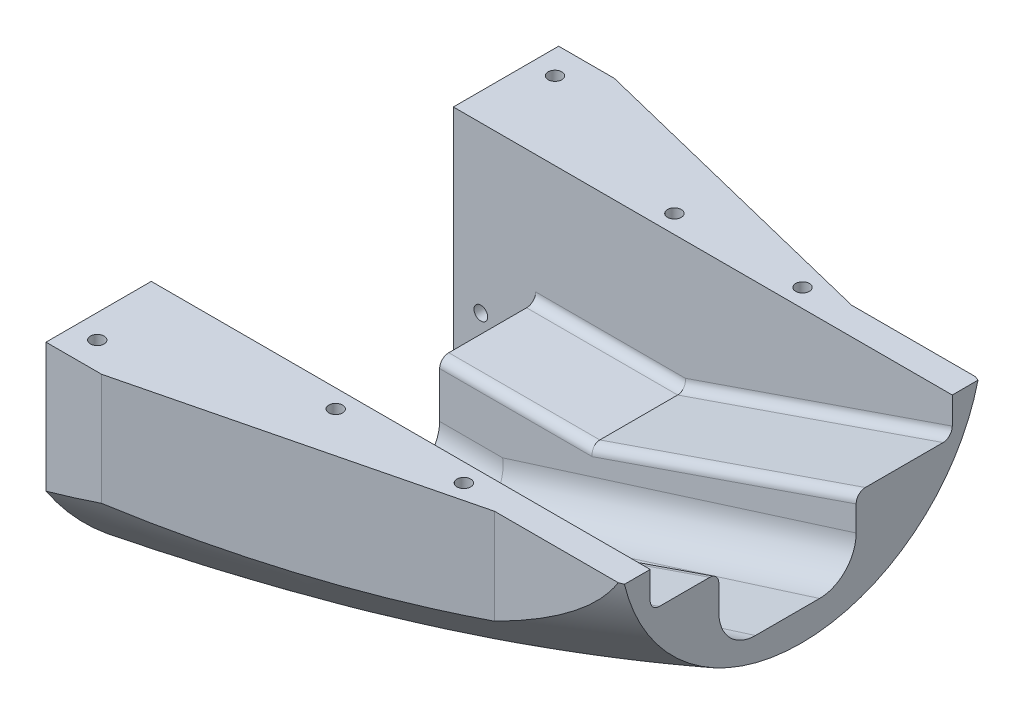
ISO-10303-21;
HEADER;
FILE_DESCRIPTION(('STEP AP214'),'2;1');
FILE_NAME('part.step','',(''),(''),'','','');
FILE_SCHEMA(('AUTOMOTIVE_DESIGN { 1 0 10303 214 1 1 1 1 }'));
ENDSEC;
DATA;
#1=APPLICATION_CONTEXT('core data for automotive mechanical design processes');
#2=APPLICATION_PROTOCOL_DEFINITION('international standard','automotive_design',2000,#1);
#3=PRODUCT_CONTEXT('',#1,'mechanical');
#4=PRODUCT('Part','Part','',(#3));
#5=PRODUCT_RELATED_PRODUCT_CATEGORY('part','',(#4));
#6=PRODUCT_DEFINITION_FORMATION('','',#4);
#7=PRODUCT_DEFINITION_CONTEXT('part definition',#1,'design');
#8=PRODUCT_DEFINITION('design','',#6,#7);
#9=PRODUCT_DEFINITION_SHAPE('','',#8);
#10=(LENGTH_UNIT() NAMED_UNIT(*) SI_UNIT(.MILLI.,.METRE.));
#11=(NAMED_UNIT(*) PLANE_ANGLE_UNIT() SI_UNIT($,.RADIAN.));
#12=(NAMED_UNIT(*) SI_UNIT($,.STERADIAN.) SOLID_ANGLE_UNIT());
#13=UNCERTAINTY_MEASURE_WITH_UNIT(LENGTH_MEASURE(1.E-05),#10,'distance_accuracy_value','');
#14=(GEOMETRIC_REPRESENTATION_CONTEXT(3) GLOBAL_UNCERTAINTY_ASSIGNED_CONTEXT((#13)) GLOBAL_UNIT_ASSIGNED_CONTEXT((#10,
#11,#12)) REPRESENTATION_CONTEXT('',''));
#15=CARTESIAN_POINT('',(0.,0.,0.));
#16=DIRECTION('',(0.,0.,1.));
#17=DIRECTION('',(1.,0.,0.));
#18=AXIS2_PLACEMENT_3D('',#15,#16,#17);
#19=CARTESIAN_POINT('',(688.975,0.,0.));
#20=DIRECTION('',(1.,0.,0.));
#21=DIRECTION('',(0.,0.,-1.));
#22=AXIS2_PLACEMENT_3D('',#19,#20,#21);
#23=PLANE('',#22);
#24=CARTESIAN_POINT('',(688.975000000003,0.,0.));
#25=DIRECTION('',(1.,0.,0.));
#26=DIRECTION('',(0.,1.,0.));
#27=AXIS2_PLACEMENT_3D('',#24,#25,#26);
#28=CIRCLE('',#27,213.877673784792);
#29=CARTESIAN_POINT('',(688.975,-186.456050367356,-104.775));
#30=VERTEX_POINT('',#29);
#31=CARTESIAN_POINT('',(688.975000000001,-118.873122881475,-177.8));
#32=VERTEX_POINT('',#31);
#33=EDGE_CURVE('E251',#30,#32,#28,.T.);
#34=ORIENTED_EDGE('',*,*,#33,.F.);
#35=DIRECTION('',(0.,-1.,0.));
#36=VECTOR('',#35,1.);
#37=CARTESIAN_POINT('',(688.975000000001,-29.36875,-104.775));
#38=LINE('',#37,#36);
#39=CARTESIAN_POINT('',(688.975000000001,-29.36875,-104.775));
#40=VERTEX_POINT('',#39);
#41=EDGE_CURVE('E233',#40,#30,#38,.T.);
#42=ORIENTED_EDGE('',*,*,#41,.F.);
#43=DIRECTION('',(0.,0.,1.));
#44=VECTOR('',#43,1.);
#45=CARTESIAN_POINT('',(688.975,-29.36875,0.));
#46=LINE('',#45,#44);
#47=CARTESIAN_POINT('',(688.975000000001,-29.36875,-177.8));
#48=VERTEX_POINT('',#47);
#49=EDGE_CURVE('E265',#48,#40,#46,.T.);
#50=ORIENTED_EDGE('',*,*,#49,.F.);
#51=DIRECTION('',(0.,1.,0.));
#52=VECTOR('',#51,1.);
#53=CARTESIAN_POINT('',(688.975000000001,-213.878673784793,-177.8));
#54=LINE('',#53,#52);
#55=EDGE_CURVE('E258',#32,#48,#54,.T.);
#56=ORIENTED_EDGE('',*,*,#55,.F.);
#57=EDGE_LOOP('',(#34,#42,#50,#56));
#58=FACE_BOUND('',#57,.T.);
#59=ADVANCED_FACE('F36',(#58),#23,.F.);
#60=CARTESIAN_POINT('',(850.9,-118.26875,104.775));
#61=DIRECTION('',(0.,1.,0.));
#62=DIRECTION('',(-1.,0.,0.));
#63=AXIS2_PLACEMENT_3D('',#60,#61,#62);
#64=PLANE('',#63);
#65=DIRECTION('',(1.,0.,0.));
#66=VECTOR('',#65,1.);
#67=CARTESIAN_POINT('',(688.975000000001,-118.26875,-98.425));
#68=LINE('',#67,#66);
#69=CARTESIAN_POINT('',(850.9,-118.26875,-98.425));
#70=VERTEX_POINT('',#69);
#71=CARTESIAN_POINT('',(746.125,-118.26875,-98.425));
#72=VERTEX_POINT('',#71);
#73=EDGE_CURVE('E560',#70,#72,#68,.F.);
#74=ORIENTED_EDGE('',*,*,#73,.T.);
#75=DIRECTION('',(0.,0.,1.));
#76=VECTOR('',#75,1.);
#77=CARTESIAN_POINT('',(746.125,-118.26875,104.775));
#78=LINE('',#77,#76);
#79=CARTESIAN_POINT('',(746.125,-118.26875,-44.45));
#80=VERTEX_POINT('',#79);
#81=EDGE_CURVE('E740',#72,#80,#78,.T.);
#82=ORIENTED_EDGE('',*,*,#81,.T.);
#83=DIRECTION('',(1.,0.,0.));
#84=VECTOR('',#83,1.);
#85=CARTESIAN_POINT('',(850.9,-118.26875,-44.45));
#86=LINE('',#85,#84);
#87=CARTESIAN_POINT('',(850.9,-118.26875,-44.45));
#88=VERTEX_POINT('',#87);
#89=EDGE_CURVE('E563',#80,#88,#86,.T.);
#90=ORIENTED_EDGE('',*,*,#89,.T.);
#91=DIRECTION('',(0.,0.,-1.));
#92=VECTOR('',#91,1.);
#93=CARTESIAN_POINT('',(850.9,-118.26875,104.775));
#94=LINE('',#93,#92);
#95=EDGE_CURVE('E636',#88,#70,#94,.T.);
#96=ORIENTED_EDGE('',*,*,#95,.T.);
#97=EDGE_LOOP('',(#74,#82,#90,#96));
#98=FACE_BOUND('',#97,.T.);
#99=ADVANCED_FACE('F471',(#98),#64,.T.);
#100=DIRECTION('',(1.,0.,0.));
#101=VECTOR('',#100,1.);
#102=CARTESIAN_POINT('',(688.975000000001,-118.26875,63.5));
#103=LINE('',#102,#101);
#104=CARTESIAN_POINT('',(850.9,-118.26875,63.5));
#105=VERTEX_POINT('',#104);
#106=CARTESIAN_POINT('',(746.125,-118.26875,63.5));
#107=VERTEX_POINT('',#106);
#108=EDGE_CURVE('E523',#105,#107,#103,.F.);
#109=ORIENTED_EDGE('',*,*,#108,.T.);
#110=DIRECTION('',(0.,0.,1.));
#111=VECTOR('',#110,1.);
#112=CARTESIAN_POINT('',(746.125,-118.26875,104.775));
#113=LINE('',#112,#111);
#114=CARTESIAN_POINT('',(746.125,-118.26875,98.425));
#115=VERTEX_POINT('',#114);
#116=EDGE_CURVE('E660',#107,#115,#113,.T.);
#117=ORIENTED_EDGE('',*,*,#116,.T.);
#118=DIRECTION('',(1.,0.,0.));
#119=VECTOR('',#118,1.);
#120=CARTESIAN_POINT('',(850.9,-118.26875,98.425));
#121=LINE('',#120,#119);
#122=CARTESIAN_POINT('',(850.9,-118.26875,98.425));
#123=VERTEX_POINT('',#122);
#124=EDGE_CURVE('E527',#115,#123,#121,.T.);
#125=ORIENTED_EDGE('',*,*,#124,.T.);
#126=EDGE_CURVE('E638',#123,#105,#94,.T.);
#127=ORIENTED_EDGE('',*,*,#126,.T.);
#128=EDGE_LOOP('',(#109,#117,#125,#127));
#129=FACE_BOUND('',#128,.T.);
#130=ADVANCED_FACE('F456',(#129),#64,.T.);
#131=CARTESIAN_POINT('',(603.25,-181.76875,38.1));
#132=DIRECTION('',(0.,1.,0.));
#133=DIRECTION('',(0.,0.,1.));
#134=AXIS2_PLACEMENT_3D('',#131,#132,#133);
#135=PLANE('',#134);
#136=DIRECTION('',(1.,0.,0.));
#137=VECTOR('',#136,1.);
#138=CARTESIAN_POINT('',(688.975,-181.76875,-12.7));
#139=LINE('',#138,#137);
#140=CARTESIAN_POINT('',(793.75,-181.76875,-12.7));
#141=VERTEX_POINT('',#140);
#142=CARTESIAN_POINT('',(746.125,-181.76875,-12.7));
#143=VERTEX_POINT('',#142);
#144=EDGE_CURVE('E592',#141,#143,#139,.F.);
#145=ORIENTED_EDGE('',*,*,#144,.T.);
#146=DIRECTION('',(0.,0.,1.));
#147=VECTOR('',#146,1.);
#148=CARTESIAN_POINT('',(746.125,-181.76875,38.1));
#149=LINE('',#148,#147);
#150=CARTESIAN_POINT('',(746.125,-181.76875,31.75));
#151=VERTEX_POINT('',#150);
#152=EDGE_CURVE('E51',#143,#151,#149,.T.);
#153=ORIENTED_EDGE('',*,*,#152,.T.);
#154=DIRECTION('',(-1.,0.,0.));
#155=VECTOR('',#154,1.);
#156=CARTESIAN_POINT('',(603.25,-181.76875,31.75));
#157=LINE('',#156,#155);
#158=CARTESIAN_POINT('',(793.75,-181.76875,31.75));
#159=VERTEX_POINT('',#158);
#160=EDGE_CURVE('E595',#151,#159,#157,.F.);
#161=ORIENTED_EDGE('',*,*,#160,.T.);
#162=DIRECTION('',(0.,0.,-1.));
#163=VECTOR('',#162,1.);
#164=CARTESIAN_POINT('',(793.75,-181.76875,38.1));
#165=LINE('',#164,#163);
#166=EDGE_CURVE('E623',#159,#141,#165,.T.);
#167=ORIENTED_EDGE('',*,*,#166,.T.);
#168=EDGE_LOOP('',(#145,#153,#161,#167));
#169=FACE_BOUND('',#168,.T.);
#170=ADVANCED_FACE('F450',(#169),#135,.T.);
#171=CARTESIAN_POINT('',(603.25,-29.36875,-38.1));
#172=DIRECTION('',(0.,0.,1.));
#173=DIRECTION('',(1.,0.,0.));
#174=AXIS2_PLACEMENT_3D('',#171,#172,#173);
#175=PLANE('',#174);
#176=DIRECTION('',(1.,0.,0.));
#177=VECTOR('',#176,1.);
#178=CARTESIAN_POINT('',(603.25,-124.61875,-38.1));
#179=LINE('',#178,#177);
#180=CARTESIAN_POINT('',(851.964084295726,-124.61875,-38.1));
#181=VERTEX_POINT('',#180);
#182=CARTESIAN_POINT('',(746.125,-124.61875,-38.1));
#183=VERTEX_POINT('',#182);
#184=EDGE_CURVE('E555',#181,#183,#179,.F.);
#185=ORIENTED_EDGE('',*,*,#184,.T.);
#186=DIRECTION('',(0.,-1.,0.));
#187=VECTOR('',#186,1.);
#188=CARTESIAN_POINT('',(746.125,-29.36875,-38.1));
#189=LINE('',#188,#187);
#190=CARTESIAN_POINT('',(746.125,-156.36875,-38.1));
#191=VERTEX_POINT('',#190);
#192=EDGE_CURVE('E759',#183,#191,#189,.T.);
#193=ORIENTED_EDGE('',*,*,#192,.T.);
#194=DIRECTION('',(1.,0.,0.));
#195=VECTOR('',#194,1.);
#196=CARTESIAN_POINT('',(793.75,-156.36875,-38.1));
#197=LINE('',#196,#195);
#198=CARTESIAN_POINT('',(789.834764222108,-156.36875,-38.1));
#199=VERTEX_POINT('',#198);
#200=EDGE_CURVE('E59',#191,#199,#197,.T.);
#201=ORIENTED_EDGE('',*,*,#200,.T.);
#202=DIRECTION('',(0.953582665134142,0.301131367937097,0.));
#203=VECTOR('',#202,1.);
#204=CARTESIAN_POINT('',(1027.4012632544,-81.3477503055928,-38.1));
#205=LINE('',#204,#203);
#206=CARTESIAN_POINT('',(1035.05,-78.93235975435,-38.1));
#207=VERTEX_POINT('',#206);
#208=EDGE_CURVE('E601',#199,#207,#205,.T.);
#209=ORIENTED_EDGE('',*,*,#208,.T.);
#210=DIRECTION('',(0.,1.,0.));
#211=VECTOR('',#210,1.);
#212=CARTESIAN_POINT('',(1035.05,-105.56875,-38.1));
#213=LINE('',#212,#211);
#214=CARTESIAN_POINT('',(1035.05,-61.4856756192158,-38.1));
#215=VERTEX_POINT('',#214);
#216=EDGE_CURVE('E617',#207,#215,#213,.T.);
#217=ORIENTED_EDGE('',*,*,#216,.T.);
#218=DIRECTION('',(0.945372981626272,0.325990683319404,0.));
#219=VECTOR('',#218,1.);
#220=CARTESIAN_POINT('',(659.035237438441,-191.145938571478,-38.1));
#221=LINE('',#220,#219);
#222=EDGE_CURVE('E558',#215,#181,#221,.F.);
#223=ORIENTED_EDGE('',*,*,#222,.T.);
#224=EDGE_LOOP('',(#185,#193,#201,#209,#217,#223));
#225=FACE_BOUND('',#224,.T.);
#226=ADVANCED_FACE('F360',(#225),#175,.T.);
#227=CARTESIAN_POINT('',(688.975,-181.76875,57.15));
#228=DIRECTION('',(0.,0.,1.));
#229=DIRECTION('',(1.,0.,0.));
#230=AXIS2_PLACEMENT_3D('',#227,#228,#229);
#231=PLANE('',#230);
#232=DIRECTION('',(0.,-1.,0.));
#233=VECTOR('',#232,1.);
#234=CARTESIAN_POINT('',(746.125,-181.76875,57.15));
#235=LINE('',#234,#233);
#236=CARTESIAN_POINT('',(746.125,-124.61875,57.15));
#237=VERTEX_POINT('',#236);
#238=CARTESIAN_POINT('',(746.125,-156.36875,57.15));
#239=VERTEX_POINT('',#238);
#240=EDGE_CURVE('E739',#237,#239,#235,.T.);
#241=ORIENTED_EDGE('',*,*,#240,.F.);
#242=DIRECTION('',(1.,0.,0.));
#243=VECTOR('',#242,1.);
#244=CARTESIAN_POINT('',(850.9,-124.61875,57.15));
#245=LINE('',#244,#243);
#246=CARTESIAN_POINT('',(851.964084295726,-124.61875,57.15));
#247=VERTEX_POINT('',#246);
#248=EDGE_CURVE('E540',#237,#247,#245,.T.);
#249=ORIENTED_EDGE('',*,*,#248,.T.);
#250=DIRECTION('',(0.945372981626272,0.325990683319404,0.));
#251=VECTOR('',#250,1.);
#252=CARTESIAN_POINT('',(1037.12004083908,-60.7718684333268,57.15));
#253=LINE('',#252,#251);
#254=CARTESIAN_POINT('',(1035.05,-61.4856756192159,57.15));
#255=VERTEX_POINT('',#254);
#256=EDGE_CURVE('E542',#247,#255,#253,.T.);
#257=ORIENTED_EDGE('',*,*,#256,.T.);
#258=DIRECTION('',(0.,-1.,0.));
#259=VECTOR('',#258,1.);
#260=CARTESIAN_POINT('',(1035.05,-54.76875,57.15));
#261=LINE('',#260,#259);
#262=CARTESIAN_POINT('',(1035.05,-78.9323597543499,57.15));
#263=VERTEX_POINT('',#262);
#264=EDGE_CURVE('E577',#255,#263,#261,.T.);
#265=ORIENTED_EDGE('',*,*,#264,.T.);
#266=DIRECTION('',(-0.953582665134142,-0.301131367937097,0.));
#267=VECTOR('',#266,1.);
#268=CARTESIAN_POINT('',(690.827270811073,-187.634274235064,57.15));
#269=LINE('',#268,#267);
#270=CARTESIAN_POINT('',(789.834764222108,-156.36875,57.15));
#271=VERTEX_POINT('',#270);
#272=EDGE_CURVE('E573',#263,#271,#269,.T.);
#273=ORIENTED_EDGE('',*,*,#272,.T.);
#274=DIRECTION('',(-1.,0.,0.));
#275=VECTOR('',#274,1.);
#276=CARTESIAN_POINT('',(688.975,-156.36875,57.15));
#277=LINE('',#276,#275);
#278=EDGE_CURVE('E589',#271,#239,#277,.T.);
#279=ORIENTED_EDGE('',*,*,#278,.T.);
#280=EDGE_LOOP('',(#241,#249,#257,#265,#273,#279));
#281=FACE_BOUND('',#280,.T.);
#282=ADVANCED_FACE('F357',(#281),#231,.F.);
#283=CARTESIAN_POINT('',(850.9,-111.91875,98.425));
#284=DIRECTION('',(1.,0.,0.));
#285=DIRECTION('',(0.,1.,0.));
#286=AXIS2_PLACEMENT_3D('',#283,#284,#285);
#287=CYLINDRICAL_SURFACE('',#286,6.35);
#288=CARTESIAN_POINT('',(746.125,-111.91875,98.425));
#289=DIRECTION('',(-1.,0.,0.));
#290=DIRECTION('',(0.,0.,1.));
#291=AXIS2_PLACEMENT_3D('',#288,#289,#290);
#292=CIRCLE('',#291,6.35);
#293=CARTESIAN_POINT('',(746.125,-111.91875,104.775));
#294=VERTEX_POINT('',#293);
#295=EDGE_CURVE('E752',#294,#115,#292,.F.);
#296=ORIENTED_EDGE('',*,*,#295,.F.);
#297=DIRECTION('',(1.,0.,0.));
#298=VECTOR('',#297,1.);
#299=CARTESIAN_POINT('',(1035.05,-111.91875,104.775));
#300=LINE('',#299,#298);
#301=CARTESIAN_POINT('',(849.835915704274,-111.91875,104.775));
#302=VERTEX_POINT('',#301);
#303=EDGE_CURVE('E534',#302,#294,#300,.F.);
#304=ORIENTED_EDGE('',*,*,#303,.F.);
#305=CARTESIAN_POINT('',(849.835915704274,-111.91875,98.425));
#306=DIRECTION('',(0.986248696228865,0.165267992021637,0.));
#307=DIRECTION('',(0.165267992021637,-0.986248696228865,0.));
#308=AXIS2_PLACEMENT_3D('',#305,#306,#307);
#309=ELLIPSE('',#308,6.43853829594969,6.35);
#310=EDGE_CURVE('E574',#302,#123,#309,.T.);
#311=ORIENTED_EDGE('',*,*,#310,.T.);
#312=ORIENTED_EDGE('',*,*,#124,.F.);
#313=EDGE_LOOP('',(#296,#304,#311,#312));
#314=FACE_BOUND('',#313,.T.);
#315=ADVANCED_FACE('F286',(#314),#287,.F.);
#316=CARTESIAN_POINT('',(688.975,-124.61875,63.5));
#317=DIRECTION('',(-1.,0.,0.));
#318=DIRECTION('',(0.,-1.,0.));
#319=AXIS2_PLACEMENT_3D('',#316,#317,#318);
#320=CYLINDRICAL_SURFACE('',#319,6.35);
#321=ORIENTED_EDGE('',*,*,#248,.F.);
#322=CARTESIAN_POINT('',(746.125,-124.61875,63.5));
#323=DIRECTION('',(-1.,0.,0.));
#324=DIRECTION('',(0.,0.,1.));
#325=AXIS2_PLACEMENT_3D('',#322,#323,#324);
#326=CIRCLE('',#325,6.35);
#327=EDGE_CURVE('E657',#237,#107,#326,.F.);
#328=ORIENTED_EDGE('',*,*,#327,.T.);
#329=ORIENTED_EDGE('',*,*,#108,.F.);
#330=CARTESIAN_POINT('',(851.964084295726,-124.61875,63.5));
#331=DIRECTION('',(-0.986248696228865,-0.165267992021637,0.));
#332=DIRECTION('',(0.165267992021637,-0.986248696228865,0.));
#333=AXIS2_PLACEMENT_3D('',#330,#331,#332);
#334=ELLIPSE('',#333,6.43853829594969,6.35);
#335=EDGE_CURVE('E578',#247,#105,#334,.F.);
#336=ORIENTED_EDGE('',*,*,#335,.F.);
#337=EDGE_LOOP('',(#321,#328,#329,#336));
#338=FACE_BOUND('',#337,.T.);
#339=ADVANCED_FACE('F655',(#338),#320,.T.);
#340=CARTESIAN_POINT('',(850.9,-124.61875,-44.45));
#341=DIRECTION('',(1.,0.,0.));
#342=DIRECTION('',(0.,1.,0.));
#343=AXIS2_PLACEMENT_3D('',#340,#341,#342);
#344=CYLINDRICAL_SURFACE('',#343,6.35);
#345=ORIENTED_EDGE('',*,*,#89,.F.);
#346=CARTESIAN_POINT('',(746.125,-124.61875,-44.45));
#347=DIRECTION('',(-1.,0.,0.));
#348=DIRECTION('',(0.,0.,1.));
#349=AXIS2_PLACEMENT_3D('',#346,#347,#348);
#350=CIRCLE('',#349,6.35);
#351=EDGE_CURVE('E741',#80,#183,#350,.F.);
#352=ORIENTED_EDGE('',*,*,#351,.T.);
#353=ORIENTED_EDGE('',*,*,#184,.F.);
#354=CARTESIAN_POINT('',(851.964084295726,-124.61875,-44.45));
#355=DIRECTION('',(0.986248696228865,0.165267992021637,0.));
#356=DIRECTION('',(-0.165267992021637,0.986248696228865,0.));
#357=AXIS2_PLACEMENT_3D('',#354,#355,#356);
#358=ELLIPSE('',#357,6.43853829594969,6.35);
#359=EDGE_CURVE('E581',#88,#181,#358,.T.);
#360=ORIENTED_EDGE('',*,*,#359,.F.);
#361=EDGE_LOOP('',(#345,#352,#353,#360));
#362=FACE_BOUND('',#361,.T.);
#363=ADVANCED_FACE('F770',(#362),#344,.T.);
#364=CARTESIAN_POINT('',(1035.05,-111.91875,-98.425));
#365=DIRECTION('',(-1.,0.,0.));
#366=DIRECTION('',(0.,-1.,0.));
#367=AXIS2_PLACEMENT_3D('',#364,#365,#366);
#368=CYLINDRICAL_SURFACE('',#367,6.35);
#369=CARTESIAN_POINT('',(746.125,-111.91875,-98.425));
#370=DIRECTION('',(-1.,0.,0.));
#371=DIRECTION('',(0.,0.,1.));
#372=AXIS2_PLACEMENT_3D('',#369,#370,#371);
#373=CIRCLE('',#372,6.35);
#374=CARTESIAN_POINT('',(746.125,-111.91875,-104.775));
#375=VERTEX_POINT('',#374);
#376=EDGE_CURVE('E744',#72,#375,#373,.F.);
#377=ORIENTED_EDGE('',*,*,#376,.F.);
#378=ORIENTED_EDGE('',*,*,#73,.F.);
#379=CARTESIAN_POINT('',(849.835915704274,-111.91875,-98.425));
#380=DIRECTION('',(-0.986248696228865,-0.165267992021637,0.));
#381=DIRECTION('',(-0.165267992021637,0.986248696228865,0.));
#382=AXIS2_PLACEMENT_3D('',#379,#380,#381);
#383=ELLIPSE('',#382,6.43853829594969,6.35);
#384=CARTESIAN_POINT('',(849.835915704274,-111.91875,-104.775));
#385=VERTEX_POINT('',#384);
#386=EDGE_CURVE('E584',#70,#385,#383,.F.);
#387=ORIENTED_EDGE('',*,*,#386,.T.);
#388=DIRECTION('',(1.,0.,0.));
#389=VECTOR('',#388,1.);
#390=CARTESIAN_POINT('',(850.9,-111.91875,-104.775));
#391=LINE('',#390,#389);
#392=EDGE_CURVE('E567',#375,#385,#391,.T.);
#393=ORIENTED_EDGE('',*,*,#392,.F.);
#394=EDGE_LOOP('',(#377,#378,#387,#393));
#395=FACE_BOUND('',#394,.T.);
#396=ADVANCED_FACE('F780',(#395),#368,.F.);
#397=CARTESIAN_POINT('',(688.975,-156.36875,31.75));
#398=DIRECTION('',(-1.,0.,0.));
#399=DIRECTION('',(0.,0.,1.));
#400=AXIS2_PLACEMENT_3D('',#397,#398,#399);
#401=CYLINDRICAL_SURFACE('',#400,25.4);
#402=CARTESIAN_POINT('',(746.125,-156.36875,31.75));
#403=DIRECTION('',(-1.,0.,0.));
#404=DIRECTION('',(0.,0.,1.));
#405=AXIS2_PLACEMENT_3D('',#402,#403,#404);
#406=CIRCLE('',#405,25.4);
#407=EDGE_CURVE('E738',#239,#151,#406,.F.);
#408=ORIENTED_EDGE('',*,*,#407,.F.);
#409=ORIENTED_EDGE('',*,*,#278,.F.);
#410=CARTESIAN_POINT('',(789.834764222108,-156.36875,31.75));
#411=DIRECTION('',(-0.988327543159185,-0.152343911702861,0.));
#412=DIRECTION('',(-0.152343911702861,0.988327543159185,0.));
#413=AXIS2_PLACEMENT_3D('',#410,#411,#412);
#414=ELLIPSE('',#413,25.6999819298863,25.4);
#415=EDGE_CURVE('E587',#271,#159,#414,.F.);
#416=ORIENTED_EDGE('',*,*,#415,.T.);
#417=ORIENTED_EDGE('',*,*,#160,.F.);
#418=EDGE_LOOP('',(#408,#409,#416,#417));
#419=FACE_BOUND('',#418,.T.);
#420=ADVANCED_FACE('F737',(#419),#401,.F.);
#421=CARTESIAN_POINT('',(603.25,-156.36875,-12.7));
#422=DIRECTION('',(-1.,0.,0.));
#423=DIRECTION('',(0.,0.,1.));
#424=AXIS2_PLACEMENT_3D('',#421,#422,#423);
#425=CYLINDRICAL_SURFACE('',#424,25.4);
#426=CARTESIAN_POINT('',(746.125,-156.36875,-12.7));
#427=DIRECTION('',(-1.,0.,0.));
#428=DIRECTION('',(0.,0.,1.));
#429=AXIS2_PLACEMENT_3D('',#426,#427,#428);
#430=CIRCLE('',#429,25.4);
#431=EDGE_CURVE('E13',#143,#191,#430,.F.);
#432=ORIENTED_EDGE('',*,*,#431,.F.);
#433=ORIENTED_EDGE('',*,*,#144,.F.);
#434=CARTESIAN_POINT('',(789.834764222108,-156.36875,-12.7));
#435=DIRECTION('',(-0.988327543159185,-0.152343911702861,0.));
#436=DIRECTION('',(-0.152343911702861,0.988327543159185,0.));
#437=AXIS2_PLACEMENT_3D('',#434,#435,#436);
#438=ELLIPSE('',#437,25.6999819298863,25.4);
#439=EDGE_CURVE('E512',#141,#199,#438,.F.);
#440=ORIENTED_EDGE('',*,*,#439,.T.);
#441=ORIENTED_EDGE('',*,*,#200,.F.);
#442=EDGE_LOOP('',(#432,#433,#440,#441));
#443=FACE_BOUND('',#442,.T.);
#444=ADVANCED_FACE('F476',(#443),#425,.F.);
#445=CARTESIAN_POINT('',(0.,-29.36875,0.));
#446=DIRECTION('',(0.,1.,0.));
#447=DIRECTION('',(0.,0.,1.));
#448=AXIS2_PLACEMENT_3D('',#445,#446,#447);
#449=PLANE('',#448);
#450=CARTESIAN_POINT('',(705.485000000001,-29.36875,-158.75));
#451=DIRECTION('',(0.,1.,0.));
#452=DIRECTION('',(0.,0.,-1.));
#453=AXIS2_PLACEMENT_3D('',#450,#451,#452);
#454=CIRCLE('',#453,4.76250000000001);
#455=CARTESIAN_POINT('',(705.485000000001,-29.36875,-163.5125));
#456=VERTEX_POINT('',#455);
#457=EDGE_CURVE('E924',#456,#456,#454,.T.);
#458=ORIENTED_EDGE('',*,*,#457,.F.);
#459=EDGE_LOOP('',(#458));
#460=FACE_BOUND('',#459,.T.);
#461=CARTESIAN_POINT('',(918.50464,-29.36875,-117.475));
#462=DIRECTION('',(0.,1.,0.));
#463=DIRECTION('',(0.,0.,1.));
#464=AXIS2_PLACEMENT_3D('',#461,#462,#463);
#465=CIRCLE('',#464,4.76250000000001);
#466=CARTESIAN_POINT('',(918.50464,-29.36875,-112.7125));
#467=VERTEX_POINT('',#466);
#468=EDGE_CURVE('E721',#467,#467,#465,.T.);
#469=ORIENTED_EDGE('',*,*,#468,.F.);
#470=EDGE_LOOP('',(#469));
#471=FACE_BOUND('',#470,.T.);
#472=CARTESIAN_POINT('',(829.60464,-29.36875,-117.475));
#473=DIRECTION('',(0.,1.,0.));
#474=DIRECTION('',(0.,0.,1.));
#475=AXIS2_PLACEMENT_3D('',#472,#473,#474);
#476=CIRCLE('',#475,4.76250000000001);
#477=CARTESIAN_POINT('',(829.60464,-29.36875,-112.7125));
#478=VERTEX_POINT('',#477);
#479=EDGE_CURVE('E409',#478,#478,#476,.T.);
#480=ORIENTED_EDGE('',*,*,#479,.F.);
#481=EDGE_LOOP('',(#480));
#482=FACE_BOUND('',#481,.T.);
#483=DIRECTION('',(-0.970843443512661,0.,-0.239714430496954));
#484=VECTOR('',#483,1.);
#485=CARTESIAN_POINT('',(946.15,-29.36875,-123.825));
#486=LINE('',#485,#484);
#487=CARTESIAN_POINT('',(946.15,-29.36875,-123.825));
#488=VERTEX_POINT('',#487);
#489=CARTESIAN_POINT('',(727.551250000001,-29.36875,-177.8));
#490=VERTEX_POINT('',#489);
#491=EDGE_CURVE('E686',#488,#490,#486,.T.);
#492=ORIENTED_EDGE('',*,*,#491,.T.);
#493=DIRECTION('',(-1.,0.,0.));
#494=VECTOR('',#493,1.);
#495=CARTESIAN_POINT('',(688.975000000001,-29.36875,-177.8));
#496=LINE('',#495,#494);
#497=EDGE_CURVE('E692',#490,#48,#496,.T.);
#498=ORIENTED_EDGE('',*,*,#497,.T.);
#499=ORIENTED_EDGE('',*,*,#49,.T.);
#500=DIRECTION('',(-1.,0.,0.));
#501=VECTOR('',#500,1.);
#502=CARTESIAN_POINT('',(1035.05,-29.36875,-104.775));
#503=LINE('',#502,#501);
#504=CARTESIAN_POINT('',(1035.05,-29.36875,-104.775));
#505=VERTEX_POINT('',#504);
#506=EDGE_CURVE('E240',#505,#40,#503,.T.);
#507=ORIENTED_EDGE('',*,*,#506,.F.);
#508=DIRECTION('',(0.,0.,1.));
#509=VECTOR('',#508,1.);
#510=CARTESIAN_POINT('',(1035.05,-29.36875,0.));
#511=LINE('',#510,#509);
#512=CARTESIAN_POINT('',(1035.05,-29.36875,-122.625652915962));
#513=VERTEX_POINT('',#512);
#514=EDGE_CURVE('E273',#513,#505,#511,.T.);
#515=ORIENTED_EDGE('',*,*,#514,.F.);
#516=CARTESIAN_POINT('',(1035.04999999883,-29.36875,-122.625652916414));
#517=CARTESIAN_POINT('',(1030.02917322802,-29.36875,-124.561560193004));
#518=CARTESIAN_POINT('',(1024.99727783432,-29.36875,-126.468763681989));
#519=CARTESIAN_POINT('',(1014.91260395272,-29.36875,-130.22533629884));
#520=CARTESIAN_POINT('',(1009.85982793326,-29.36875,-132.074712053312));
#521=CARTESIAN_POINT('',(999.733929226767,-29.36875,-135.715490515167));
#522=CARTESIAN_POINT('',(994.660808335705,-29.36875,-137.506898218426));
#523=CARTESIAN_POINT('',(984.494677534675,-29.36875,-141.031441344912));
#524=CARTESIAN_POINT('',(979.401668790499,-29.36875,-142.764580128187));
#525=CARTESIAN_POINT('',(971.747576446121,-29.36875,-145.320303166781));
#526=CARTESIAN_POINT('',(969.193813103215,-29.36875,-146.164870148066));
#527=CARTESIAN_POINT('',(964.081458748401,-29.36875,-147.83927385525));
#528=CARTESIAN_POINT('',(961.522867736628,-29.36875,-148.669110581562));
#529=CARTESIAN_POINT('',(956.400996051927,-29.36875,-150.314172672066));
#530=CARTESIAN_POINT('',(953.837715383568,-29.36875,-151.129398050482));
#531=CARTESIAN_POINT('',(948.706605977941,-29.36875,-152.745398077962));
#532=CARTESIAN_POINT('',(946.138777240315,-29.36875,-153.54617272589));
#533=CARTESIAN_POINT('',(938.443839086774,-29.36875,-155.922358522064));
#534=CARTESIAN_POINT('',(933.310141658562,-29.36875,-157.47649040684));
#535=CARTESIAN_POINT('',(923.026138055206,-29.36875,-160.529069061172));
#536=CARTESIAN_POINT('',(917.875831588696,-29.36875,-162.027514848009));
#537=CARTESIAN_POINT('',(907.55955894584,-29.36875,-164.969858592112));
#538=CARTESIAN_POINT('',(902.393592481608,-29.36875,-166.413755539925));
#539=CARTESIAN_POINT('',(892.046958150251,-29.36875,-169.24809296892));
#540=CARTESIAN_POINT('',(886.866290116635,-29.36875,-170.638532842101));
#541=CARTESIAN_POINT('',(876.491204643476,-29.36875,-173.36704555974));
#542=CARTESIAN_POINT('',(871.29678724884,-29.36875,-174.705118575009));
#543=CARTESIAN_POINT('',(860.89512763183,-29.36875,-177.329871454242));
#544=CARTESIAN_POINT('',(855.687885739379,-29.36875,-178.616552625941));
#545=CARTESIAN_POINT('',(846.034258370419,-29.36875,-180.953390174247));
#546=CARTESIAN_POINT('',(841.589513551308,-29.36875,-182.010333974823));
#547=CARTESIAN_POINT('',(832.692048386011,-29.36875,-184.089606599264));
#548=CARTESIAN_POINT('',(828.239328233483,-29.36875,-185.11193625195));
#549=CARTESIAN_POINT('',(819.326396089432,-29.36875,-187.123255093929));
#550=CARTESIAN_POINT('',(814.866184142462,-29.36875,-188.112244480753));
#551=CARTESIAN_POINT('',(805.938748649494,-29.36875,-190.058159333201));
#552=CARTESIAN_POINT('',(801.47152506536,-29.36875,-191.01508462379));
#553=CARTESIAN_POINT('',(792.530546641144,-29.36875,-192.898137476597));
#554=CARTESIAN_POINT('',(788.056791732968,-29.36875,-193.824264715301));
#555=CARTESIAN_POINT('',(779.1032253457,-29.36875,-195.646987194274));
#556=CARTESIAN_POINT('',(774.623413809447,-29.36875,-196.543582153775));
#557=CARTESIAN_POINT('',(767.893753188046,-29.36875,-197.868393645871));
#558=CARTESIAN_POINT('',(765.645983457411,-29.36875,-198.307201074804));
#559=CARTESIAN_POINT('',(761.149101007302,-29.36875,-199.177879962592));
#560=CARTESIAN_POINT('',(758.899988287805,-29.36875,-199.609751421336));
#561=CARTESIAN_POINT('',(752.150683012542,-29.36875,-200.894996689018));
#562=CARTESIAN_POINT('',(747.648511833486,-29.36875,-201.738003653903));
#563=CARTESIAN_POINT('',(738.639155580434,-29.36875,-203.396323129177));
#564=CARTESIAN_POINT('',(734.131970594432,-29.36875,-204.211636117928));
#565=CARTESIAN_POINT('',(725.112829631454,-29.36875,-205.814546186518));
#566=CARTESIAN_POINT('',(720.600873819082,-29.36875,-206.602144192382));
#567=CARTESIAN_POINT('',(711.572437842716,-29.36875,-208.149595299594));
#568=CARTESIAN_POINT('',(707.055957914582,-29.36875,-208.909449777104));
#569=CARTESIAN_POINT('',(698.018719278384,-29.36875,-210.401386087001));
#570=CARTESIAN_POINT('',(693.497960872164,-29.36875,-211.133469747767));
#571=CARTESIAN_POINT('',(688.975000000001,-29.36875,-211.851683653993));
#572=B_SPLINE_CURVE_WITH_KNOTS('',3,(#516,#517,#518,#519,#520,#521,#522,#523,#524,#525,#526,
#527,#528,#529,#530,#531,#532,#533,#534,#535,#536,#537,#538,#539,#540,#541,#542,#543,#544,#545,
#546,#547,#548,#549,#550,#551,#552,#553,#554,#555,#556,#557,#558,#559,#560,#561,#562,#563,#564,
#565,#566,#567,#568,#569,#570,#571),.UNSPECIFIED.,.F.,.F.,(4,2,2,2,2,2,2,2,2,2,2,2,2,2,2,2,2,2,
2,2,2,2,2,2,2,2,2,4),(0.,16.1432705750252,32.2846844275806,48.4247034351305,64.5637901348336,
72.6331403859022,80.7024904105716,88.7718325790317,96.8411753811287,112.932173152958,
129.02345475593,145.115033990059,161.206796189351,177.298505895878,193.389805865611,
207.095724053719,220.80131382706,234.506822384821,248.212405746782,261.918133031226,
275.623990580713,282.494584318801,289.365178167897,303.106330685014,316.847245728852,
330.58770121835,344.327474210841,358.066341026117),.UNSPECIFIED.);
#573=CARTESIAN_POINT('',(1031.92848642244,-29.36875,-123.825));
#574=VERTEX_POINT('',#573);
#575=EDGE_CURVE('E302',#513,#574,#572,.T.);
#576=ORIENTED_EDGE('',*,*,#575,.T.);
#577=DIRECTION('',(-1.,0.,0.));
#578=VECTOR('',#577,1.);
#579=CARTESIAN_POINT('',(1035.05,-29.36875,-123.825));
#580=LINE('',#579,#578);
#581=EDGE_CURVE('E420',#574,#488,#580,.T.);
#582=ORIENTED_EDGE('',*,*,#581,.T.);
#583=EDGE_LOOP('',(#492,#498,#499,#507,#515,#576,#582));
#584=FACE_BOUND('',#583,.T.);
#585=ADVANCED_FACE('F284',(#460,#471,#482,#584),#449,.T.);
#586=CARTESIAN_POINT('',(-1187.45,-2.14764525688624E-13,0.793750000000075));
#587=CARTESIAN_POINT('',(-1187.41582639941,-2.10045071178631E-13,2.14485212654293));
#588=CARTESIAN_POINT('',(-1187.35078911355,-2.01063269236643E-13,4.71619414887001));
#589=CARTESIAN_POINT('',(-1187.0134288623,-1.86952411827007E-13,8.75174252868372));
#590=CARTESIAN_POINT('',(-1186.47507361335,-1.72346699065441E-13,12.9254698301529));
#591=CARTESIAN_POINT('',(-1185.60677768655,-1.55742877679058E-13,17.6656455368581));
#592=CARTESIAN_POINT('',(-1184.39784787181,-1.38286496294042E-13,22.6439822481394));
#593=CARTESIAN_POINT('',(-1182.81805663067,-1.20315722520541E-13,27.7630904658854));
#594=CARTESIAN_POINT('',(-1180.9000462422,-1.02322185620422E-13,32.8827389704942));
#595=CARTESIAN_POINT('',(-1178.45058427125,0.,38.3646195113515));
#596=CARTESIAN_POINT('',(-1175.42025005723,0.,44.0192595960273));
#597=CARTESIAN_POINT('',(-1171.99485787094,0.,49.3799018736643));
#598=CARTESIAN_POINT('',(-1162.66570449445,0.,61.9168794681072));
#599=CARTESIAN_POINT('',(-1135.90498590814,0.,83.8406115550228));
#600=CARTESIAN_POINT('',(-1094.24342763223,1.86864193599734E-13,114.177065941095));
#601=CARTESIAN_POINT('',(-1042.34684056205,2.86427269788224E-13,141.77560733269));
#602=CARTESIAN_POINT('',(-991.223618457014,3.68605213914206E-13,164.408518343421));
#603=CARTESIAN_POINT('',(-940.26850637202,4.38358530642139E-13,183.48584456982));
#604=CARTESIAN_POINT('',(-872.800317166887,5.16458028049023E-13,204.661680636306));
#605=CARTESIAN_POINT('',(-788.12614512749,5.92124687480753E-13,224.836541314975));
#606=CARTESIAN_POINT('',(-686.226676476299,6.57810813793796E-13,241.848338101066));
#607=CARTESIAN_POINT('',(-584.376798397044,7.00100925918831E-13,252.160122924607));
#608=CARTESIAN_POINT('',(-465.769527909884,7.31890788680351E-13,259.168263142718));
#609=CARTESIAN_POINT('',(-377.536944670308,7.41533046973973E-13,260.370064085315));
#610=CARTESIAN_POINT('',(-317.35321345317,7.45172627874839E-13,260.348501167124));
#611=CARTESIAN_POINT('',(-301.814810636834,7.46138774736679E-13,260.350515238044));
#612=CARTESIAN_POINT('',(-285.383466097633,7.47150876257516E-13,260.349905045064));
#613=CARTESIAN_POINT('',(-269.464917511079,7.48133883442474E-13,260.350027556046));
#614=CARTESIAN_POINT('',(-254.830951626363,7.49037050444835E-13,260.349992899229));
#615=CARTESIAN_POINT('',(-237.501096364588,7.50106777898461E-13,260.350002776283));
#616=CARTESIAN_POINT('',(-220.686068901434,7.51144681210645E-13,260.349999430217));
#617=CARTESIAN_POINT('',(-203.743111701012,7.52190495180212E-13,260.350000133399));
#618=CARTESIAN_POINT('',(-190.137919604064,7.53030281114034E-13,260.349999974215));
#619=CARTESIAN_POINT('',(-176.91664822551,7.53846370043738E-13,260.350000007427));
#620=CARTESIAN_POINT('',(-163.438709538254,7.54678301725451E-13,260.349999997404));
#621=CARTESIAN_POINT('',(-149.960576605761,7.55510245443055E-13,260.350000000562));
#622=CARTESIAN_POINT('',(-136.739809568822,7.56326303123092E-13,260.349999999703));
#623=CARTESIAN_POINT('',(-123.775328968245,7.57126541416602E-13,260.350000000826));
#624=CARTESIAN_POINT('',(-110.42660200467,7.57950497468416E-13,260.349999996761));
#625=CARTESIAN_POINT('',(-96.4355080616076,7.58814103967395E-13,260.350000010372));
#626=CARTESIAN_POINT('',(-84.6282308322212,7.5954291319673E-13,260.349999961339));
#627=CARTESIAN_POINT('',(-73.7156567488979,7.60216497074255E-13,260.350000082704));
#628=CARTESIAN_POINT('',(-64.9868798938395,7.60755283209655E-13,260.34999966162));
#629=CARTESIAN_POINT('',(-55.231805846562,7.61357424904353E-13,260.350001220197));
#630=CARTESIAN_POINT('',(-45.861466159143,7.61935787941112E-13,260.349993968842));
#631=CARTESIAN_POINT('',(-36.2370664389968,7.62529935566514E-13,260.35001610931));
#632=CARTESIAN_POINT('',(-26.0980257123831,7.63155448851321E-13,260.349923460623));
#633=CARTESIAN_POINT('',(-16.5997342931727,7.6374320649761E-13,260.350344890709));
#634=CARTESIAN_POINT('',(-7.42860193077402,7.64305856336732E-13,260.349358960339));
#635=CARTESIAN_POINT('',(48.1875926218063,7.67833966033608E-13,260.376618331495));
#636=CARTESIAN_POINT('',(152.453619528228,7.65953744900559E-13,257.994794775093));
#637=CARTESIAN_POINT('',(304.904930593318,7.53974660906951E-13,251.868678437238));
#638=CARTESIAN_POINT('',(440.424562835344,7.3087967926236E-13,242.858173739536));
#639=CARTESIAN_POINT('',(558.943048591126,6.97730703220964E-13,231.268650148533));
#640=CARTESIAN_POINT('',(660.71441054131,6.60910343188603E-13,218.923670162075));
#641=CARTESIAN_POINT('',(762.460039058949,6.07680139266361E-13,201.87917630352));
#642=CARTESIAN_POINT('',(864.373412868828,5.37583438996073E-13,180.000957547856));
#643=CARTESIAN_POINT('',(966.359094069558,4.43862985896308E-13,151.355344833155));
#644=CARTESIAN_POINT('',(1050.69033611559,3.42761970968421E-13,120.907964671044));
#645=CARTESIAN_POINT('',(1118.18156361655,2.47908964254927E-13,92.5477988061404));
#646=CARTESIAN_POINT('',(1151.54570991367,1.92603395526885E-13,76.1178044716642));
#647=CARTESIAN_POINT('',(1168.4,1.64665138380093E-13,67.8180000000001));
#648=B_SPLINE_CURVE_WITH_KNOTS('',3,(#586,#587,#588,#589,#590,#591,#592,#593,#594,#595,#596,
#597,#598,#599,#600,#601,#602,#603,#604,#605,#606,#607,#608,#609,#610,#611,#612,#613,#614,#615,
#616,#617,#618,#619,#620,#621,#622,#623,#624,#625,#626,#627,#628,#629,#630,#631,#632,#633,#634,
#635,#636,#637,#638,#639,#640,#641,#642,#643,#644,#645,#646,#647),.UNSPECIFIED.,.F.,.F.,(4,1,1,
1,1,1,1,1,1,1,1,1,1,1,1,1,1,1,1,1,1,1,1,1,1,1,1,1,1,1,1,1,1,1,1,1,1,1,1,1,1,1,1,1,1,1,1,1,1,1,1,
1,1,1,1,1,1,1,1,4),(0.,0.00164521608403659,0.00313108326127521,0.00492821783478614,
0.00676699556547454,0.00899569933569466,0.011161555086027,0.0132858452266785,0.0156483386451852,
0.0184669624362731,0.0210880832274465,0.0233881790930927,0.0374655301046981,0.0627504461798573,
0.0862304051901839,0.108796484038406,0.130815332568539,0.152430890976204,0.194859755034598,
0.236667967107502,0.278128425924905,0.319436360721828,0.381297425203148,0.385523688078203,
0.39271258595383,0.400215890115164,0.405529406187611,0.412093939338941,0.418033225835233,
0.426629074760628,0.432566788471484,0.43866183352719,0.443193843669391,0.448664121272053,
0.455071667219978,0.459603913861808,0.464760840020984,0.470856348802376,0.475856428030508,
0.48179545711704,0.485232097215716,0.489142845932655,0.492423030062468,0.497109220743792,
0.500551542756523,0.504141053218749,0.509453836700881,0.512116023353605,0.515307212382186,
0.577168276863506,0.63907261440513,0.701067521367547,0.742496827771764,0.784051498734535,
0.825859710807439,0.868057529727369,0.910905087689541,0.954729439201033,0.977131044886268,1.),.UNSPECIFIED.);
#649=CARTESIAN_POINT('',(1168.4,0.,0.));
#650=DIRECTION('',(1.,0.,0.));
#651=AXIS1_PLACEMENT('',#649,#650);
#652=SURFACE_OF_REVOLUTION('',#648,#651);
#653=CARTESIAN_POINT('',(746.125,0.,0.));
#654=DIRECTION('',(1.,0.,0.));
#655=DIRECTION('',(0.,1.,0.));
#656=AXIS2_PLACEMENT_3D('',#653,#654,#655);
#657=CIRCLE('',#656,204.139966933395);
#658=CARTESIAN_POINT('',(746.125,-175.20081470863,-104.775));
#659=VERTEX_POINT('',#658);
#660=CARTESIAN_POINT('',(746.125,-175.20081470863,104.775));
#661=VERTEX_POINT('',#660);
#662=EDGE_CURVE('E254',#659,#661,#657,.F.);
#663=ORIENTED_EDGE('',*,*,#662,.F.);
#664=CARTESIAN_POINT('',(746.125,-175.20081470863,-104.775));
#665=CARTESIAN_POINT('',(744.542608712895,-175.539216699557,-104.775));
#666=CARTESIAN_POINT('',(742.959751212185,-175.875438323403,-104.775));
#667=CARTESIAN_POINT('',(739.793177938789,-176.543527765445,-104.775));
#668=CARTESIAN_POINT('',(738.209462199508,-176.875395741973,-104.775));
#669=CARTESIAN_POINT('',(735.041177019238,-177.534799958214,-104.775));
#670=CARTESIAN_POINT('',(733.456607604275,-177.862336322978,-104.775));
#671=CARTESIAN_POINT('',(730.286619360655,-178.513098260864,-104.775));
#672=CARTESIAN_POINT('',(728.701200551,-178.836323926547,-104.775));
#673=CARTESIAN_POINT('',(725.529517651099,-179.47848459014,-104.775));
#674=CARTESIAN_POINT('',(723.943253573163,-179.79741964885,-104.775));
#675=CARTESIAN_POINT('',(720.769884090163,-180.431018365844,-104.775));
#676=CARTESIAN_POINT('',(719.182778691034,-180.745682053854,-104.775));
#677=CARTESIAN_POINT('',(716.007732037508,-181.370756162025,-104.775));
#678=CARTESIAN_POINT('',(714.419790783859,-181.681166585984,-104.775));
#679=CARTESIAN_POINT('',(711.243074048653,-182.297752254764,-104.775));
#680=CARTESIAN_POINT('',(709.654298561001,-182.603927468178,-104.775));
#681=CARTESIAN_POINT('',(706.475916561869,-183.212059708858,-104.775));
#682=CARTESIAN_POINT('',(704.886310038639,-183.514016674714,-104.775));
#683=CARTESIAN_POINT('',(701.706269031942,-184.113728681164,-104.775));
#684=CARTESIAN_POINT('',(700.11583453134,-184.411483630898,-104.775));
#685=CARTESIAN_POINT('',(696.934140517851,-185.002807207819,-104.775));
#686=CARTESIAN_POINT('',(695.342880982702,-185.296375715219,-104.775));
#687=CARTESIAN_POINT('',(692.159539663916,-185.879341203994,-104.775));
#688=CARTESIAN_POINT('',(690.567457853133,-186.168738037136,-104.775));
#689=CARTESIAN_POINT('',(688.975000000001,-186.456050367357,-104.775));
#690=B_SPLINE_CURVE_WITH_KNOTS('',3,(#664,#665,#666,#667,#668,#669,#670,#671,#672,#673,#674,
#675,#676,#677,#678,#679,#680,#681,#682,#683,#684,#685,#686,#687,#688,#689),.UNSPECIFIED.,.F.,
.F.,(4,2,2,2,2,2,2,2,2,2,2,2,4),(0.,4.85451202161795,9.70884700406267,14.5630415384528,
19.4171316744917,24.2711529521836,29.1251404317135,33.9791235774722,38.8331426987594,
43.6872324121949,48.5414269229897,53.3957600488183,58.2502652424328),.UNSPECIFIED.);
#691=EDGE_CURVE('E237',#659,#30,#690,.T.);
#692=ORIENTED_EDGE('',*,*,#691,.T.);
#693=ORIENTED_EDGE('',*,*,#33,.T.);
#694=CARTESIAN_POINT('',(688.975000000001,-118.873122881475,-177.8));
#695=CARTESIAN_POINT('',(691.502870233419,-118.157730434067,-177.8));
#696=CARTESIAN_POINT('',(694.027525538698,-117.430940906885,-177.8));
#697=CARTESIAN_POINT('',(699.071505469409,-115.953214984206,-177.8));
#698=CARTESIAN_POINT('',(701.590825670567,-115.202263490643,-177.8));
#699=CARTESIAN_POINT('',(706.62319568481,-113.675411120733,-177.8));
#700=CARTESIAN_POINT('',(709.136241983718,-112.899498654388,-177.8));
#701=CARTESIAN_POINT('',(714.155082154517,-111.321809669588,-177.8));
#702=CARTESIAN_POINT('',(716.660873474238,-110.520025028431,-177.8));
#703=CARTESIAN_POINT('',(721.664192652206,-108.889577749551,-177.8));
#704=CARTESIAN_POINT('',(724.161718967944,-108.060910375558,-177.8));
#705=CARTESIAN_POINT('',(729.147456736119,-106.375558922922,-177.8));
#706=CARTESIAN_POINT('',(731.635667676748,-105.518873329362,-177.8));
#707=CARTESIAN_POINT('',(736.676120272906,-103.750078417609,-177.8));
#708=CARTESIAN_POINT('',(739.228049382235,-102.837077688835,-177.8));
#709=CARTESIAN_POINT('',(744.319688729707,-100.978370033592,-177.8));
#710=CARTESIAN_POINT('',(746.859400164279,-100.032666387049,-177.8));
#711=CARTESIAN_POINT('',(751.925291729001,-98.1067043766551,-177.8));
#712=CARTESIAN_POINT('',(754.451473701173,-97.1264508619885,-177.8));
#713=CARTESIAN_POINT('',(759.488901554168,-95.1293027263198,-177.8));
#714=CARTESIAN_POINT('',(762.000149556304,-94.1124134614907,-177.8));
#715=CARTESIAN_POINT('',(767.006105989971,-92.0394129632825,-177.8));
#716=CARTESIAN_POINT('',(769.50081615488,-90.9833059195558,-177.8));
#717=CARTESIAN_POINT('',(774.471813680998,-88.8285185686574,-177.8));
#718=CARTESIAN_POINT('',(776.948101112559,-87.729838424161,-177.8));
#719=CARTESIAN_POINT('',(780.957559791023,-85.9057821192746,-177.8));
#720=CARTESIAN_POINT('',(782.497128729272,-85.1944468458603,-177.8));
#721=CARTESIAN_POINT('',(785.567333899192,-83.7526501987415,-177.8));
#722=CARTESIAN_POINT('',(787.097969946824,-83.0221884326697,-177.8));
#723=CARTESIAN_POINT('',(790.149444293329,-81.5410803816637,-177.8));
#724=CARTESIAN_POINT('',(791.670282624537,-80.7904341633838,-177.8));
#725=CARTESIAN_POINT('',(794.701240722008,-79.2677713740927,-177.8));
#726=CARTESIAN_POINT('',(796.211360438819,-78.4957547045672,-177.8));
#727=CARTESIAN_POINT('',(799.219888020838,-76.9290247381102,-177.8));
#728=CARTESIAN_POINT('',(800.718295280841,-76.1343102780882,-177.8));
#729=CARTESIAN_POINT('',(803.702321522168,-74.5206896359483,-177.8));
#730=CARTESIAN_POINT('',(805.18793860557,-73.7017799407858,-177.8));
#731=CARTESIAN_POINT('',(808.127152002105,-72.0482307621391,-177.8));
#732=CARTESIAN_POINT('',(809.580918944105,-71.213894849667,-177.8));
#733=CARTESIAN_POINT('',(812.472931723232,-69.5184762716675,-177.8));
#734=CARTESIAN_POINT('',(813.911176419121,-68.6573916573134,-177.8));
#735=CARTESIAN_POINT('',(816.770169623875,-66.906744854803,-177.8));
#736=CARTESIAN_POINT('',(818.190918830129,-66.0171838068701,-177.8));
#737=CARTESIAN_POINT('',(821.012782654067,-64.2075918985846,-177.8));
#738=CARTESIAN_POINT('',(822.413898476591,-63.2875629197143,-177.8));
#739=CARTESIAN_POINT('',(825.194146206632,-61.4147293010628,-177.8));
#740=CARTESIAN_POINT('',(826.573277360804,-60.4619235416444,-177.8));
#741=CARTESIAN_POINT('',(829.30698822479,-58.520819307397,-177.8));
#742=CARTESIAN_POINT('',(830.661560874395,-57.5325108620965,-177.8));
#743=CARTESIAN_POINT('',(832.849982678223,-55.8878811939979,-177.8));
#744=CARTESIAN_POINT('',(833.692385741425,-55.2429226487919,-177.8));
#745=CARTESIAN_POINT('',(835.36478798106,-53.9370426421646,-177.8));
#746=CARTESIAN_POINT('',(836.19478676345,-53.2761206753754,-177.8));
#747=CARTESIAN_POINT('',(837.841003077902,-51.9377138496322,-177.8));
#748=CARTESIAN_POINT('',(838.657223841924,-51.2602329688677,-177.8));
#749=CARTESIAN_POINT('',(840.274447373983,-49.888023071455,-177.8));
#750=CARTESIAN_POINT('',(841.075456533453,-49.1933015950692,-177.8));
#751=CARTESIAN_POINT('',(842.660742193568,-47.7858369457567,-177.8));
#752=CARTESIAN_POINT('',(843.445027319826,-47.0731034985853,-177.8));
#753=CARTESIAN_POINT('',(844.995260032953,-45.6287345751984,-177.8));
#754=CARTESIAN_POINT('',(845.761216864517,-44.8971090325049,-177.8));
#755=CARTESIAN_POINT('',(847.283514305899,-43.4037145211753,-177.8));
#756=CARTESIAN_POINT('',(848.039587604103,-42.6416726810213,-177.8));
#757=CARTESIAN_POINT('',(849.529248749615,-41.0958786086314,-177.8));
#758=CARTESIAN_POINT('',(850.262836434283,-40.3121262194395,-177.8));
#759=CARTESIAN_POINT('',(851.705380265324,-38.7215744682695,-177.8));
#760=CARTESIAN_POINT('',(852.414324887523,-37.9147646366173,-177.8));
#761=CARTESIAN_POINT('',(853.805205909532,-36.2765752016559,-177.8));
#762=CARTESIAN_POINT('',(854.487110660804,-35.4451686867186,-177.8));
#763=CARTESIAN_POINT('',(855.821298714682,-33.7560178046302,-177.8));
#764=CARTESIAN_POINT('',(856.473517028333,-32.8982219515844,-177.8));
#765=CARTESIAN_POINT('',(857.745284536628,-31.1542994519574,-177.8));
#766=CARTESIAN_POINT('',(858.364715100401,-30.2680863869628,-177.8));
#767=CARTESIAN_POINT('',(858.964753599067,-29.3687500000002,-177.8));
#768=B_SPLINE_CURVE_WITH_KNOTS('',3,(#694,#695,#696,#697,#698,#699,#700,#701,#702,#703,#704,
#705,#706,#707,#708,#709,#710,#711,#712,#713,#714,#715,#716,#717,#718,#719,#720,#721,#722,#723,
#724,#725,#726,#727,#728,#729,#730,#731,#732,#733,#734,#735,#736,#737,#738,#739,#740,#741,#742,
#743,#744,#745,#746,#747,#748,#749,#750,#751,#752,#753,#754,#755,#756,#757,#758,#759,#760,#761,
#762,#763,#764,#765,#766,#767),.UNSPECIFIED.,.F.,.F.,(4,2,2,2,2,2,2,2,2,2,2,2,2,2,2,2,2,2,2,2,2,
2,2,2,2,2,2,2,2,2,2,2,2,2,2,2,4),(0.,7.88143653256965,15.7678974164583,23.6580745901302,
31.5507534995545,39.4448305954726,47.3393352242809,55.470125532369,63.6001027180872,
71.7289433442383,79.8566003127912,87.9833914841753,96.1101516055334,101.197909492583,
106.285771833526,111.373617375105,116.461486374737,121.549616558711,126.638489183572,
131.666743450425,136.695364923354,141.723785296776,146.751895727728,151.780178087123,
156.809883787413,159.992566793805,163.175350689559,166.357377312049,169.538035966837,
172.717012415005,175.894350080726,179.114360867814,182.334394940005,185.555915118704,
188.781100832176,192.013037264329,195.255963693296),.UNSPECIFIED.);
#769=CARTESIAN_POINT('',(727.551249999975,-106.914457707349,-177.8));
#770=VERTEX_POINT('',#769);
#771=EDGE_CURVE('E421',#32,#770,#768,.T.);
#772=ORIENTED_EDGE('',*,*,#771,.T.);
#773=CARTESIAN_POINT('',(946.15,-95.4172180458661,-123.825));
#774=CARTESIAN_POINT('',(942.599708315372,-96.0554357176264,-124.701615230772));
#775=CARTESIAN_POINT('',(939.045561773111,-96.6708482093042,-125.579182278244));
#776=CARTESIAN_POINT('',(931.930167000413,-97.8563864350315,-127.336069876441));
#777=CARTESIAN_POINT('',(928.368918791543,-98.4265123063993,-128.215390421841));
#778=CARTESIAN_POINT('',(921.250001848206,-99.5202538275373,-129.973147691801));
#779=CARTESIAN_POINT('',(917.692351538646,-100.043996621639,-130.851579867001));
#780=CARTESIAN_POINT('',(910.571170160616,-101.04699124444,-132.609896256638));
#781=CARTESIAN_POINT('',(907.007639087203,-101.526243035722,-133.489780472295));
#782=CARTESIAN_POINT('',(896.324920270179,-102.895478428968,-136.127488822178));
#783=CARTESIAN_POINT('',(889.197597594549,-103.719398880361,-137.887321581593));
#784=CARTESIAN_POINT('',(878.499938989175,-104.82262421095,-140.528718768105));
#785=CARTESIAN_POINT('',(874.93587013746,-105.168027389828,-141.408735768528));
#786=CARTESIAN_POINT('',(867.803950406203,-105.81489020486,-143.169703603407));
#787=CARTESIAN_POINT('',(864.236099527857,-106.116349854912,-144.050654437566));
#788=CARTESIAN_POINT('',(857.101057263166,-106.675049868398,-145.812393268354));
#789=CARTESIAN_POINT('',(853.533869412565,-106.93233816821,-146.693180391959));
#790=CARTESIAN_POINT('',(846.396818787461,-107.403542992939,-148.455415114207));
#791=CARTESIAN_POINT('',(842.826956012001,-107.617459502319,-149.336862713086));
#792=CARTESIAN_POINT('',(832.118016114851,-108.194463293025,-151.981045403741));
#793=CARTESIAN_POINT('',(824.975527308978,-108.493121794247,-153.744622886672));
#794=CARTESIAN_POINT('',(814.25858261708,-108.813902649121,-156.390782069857));
#795=CARTESIAN_POINT('',(810.685771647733,-108.899628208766,-157.272957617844));
#796=CARTESIAN_POINT('',(803.539405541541,-109.028893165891,-159.037492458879));
#797=CARTESIAN_POINT('',(799.965850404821,-109.072432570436,-159.919851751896));
#798=CARTESIAN_POINT('',(792.816400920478,-109.1175116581,-161.68514792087));
#799=CARTESIAN_POINT('',(789.240506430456,-109.119026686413,-162.568084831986));
#800=CARTESIAN_POINT('',(782.088931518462,-109.080120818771,-164.333905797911));
#801=CARTESIAN_POINT('',(778.513251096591,-109.039699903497,-165.216789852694));
#802=CARTESIAN_POINT('',(771.358598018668,-108.916913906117,-166.983370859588));
#803=CARTESIAN_POINT('',(767.779626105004,-108.834502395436,-167.867067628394));
#804=CARTESIAN_POINT('',(762.412040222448,-108.679453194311,-169.192397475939));
#805=CARTESIAN_POINT('',(760.622986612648,-108.622531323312,-169.634139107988));
#806=CARTESIAN_POINT('',(757.045225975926,-108.49811726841,-170.517536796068));
#807=CARTESIAN_POINT('',(755.25651894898,-108.430625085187,-170.959192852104));
#808=CARTESIAN_POINT('',(749.885176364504,-108.211790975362,-172.285450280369));
#809=CARTESIAN_POINT('',(746.303148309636,-108.044258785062,-173.169901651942));
#810=CARTESIAN_POINT('',(739.141315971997,-107.664669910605,-174.938255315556));
#811=CARTESIAN_POINT('',(735.561511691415,-107.452613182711,-175.822157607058));
#812=CARTESIAN_POINT('',(728.39673065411,-106.981898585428,-177.591239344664));
#813=CARTESIAN_POINT('',(724.811760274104,-106.72313738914,-178.476417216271));
#814=CARTESIAN_POINT('',(717.64540194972,-106.157620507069,-180.245888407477));
#815=CARTESIAN_POINT('',(714.064013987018,-105.850865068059,-181.130181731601));
#816=CARTESIAN_POINT('',(706.894884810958,-105.18649152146,-182.900337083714));
#817=CARTESIAN_POINT('',(703.307156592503,-104.828724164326,-183.786195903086));
#818=CARTESIAN_POINT('',(696.136917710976,-104.060850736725,-185.556625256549));
#819=CARTESIAN_POINT('',(692.554407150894,-103.650743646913,-186.441195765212));
#820=CARTESIAN_POINT('',(688.975000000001,-103.213389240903,-187.325));
#821=B_SPLINE_CURVE_WITH_KNOTS('',3,(#773,#774,#775,#776,#777,#778,#779,#780,#781,#782,#783,
#784,#785,#786,#787,#788,#789,#790,#791,#792,#793,#794,#795,#796,#797,#798,#799,#800,#801,#802,
#803,#804,#805,#806,#807,#808,#809,#810,#811,#812,#813,#814,#815,#816,#817,#818,#819,#820),
.UNSPECIFIED.,.F.,.F.,(4,2,2,2,2,2,2,2,2,2,2,2,2,2,2,2,2,2,2,2,2,2,2,4),(0.,11.1364793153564,
22.2729248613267,33.3778320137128,44.4827485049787,66.6425774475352,77.7043374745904,
88.7660940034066,99.8157689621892,110.865447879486,132.952226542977,143.995373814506,
155.038519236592,166.088143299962,177.13777245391,188.199645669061,193.730604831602,
199.261563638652,210.341499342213,221.42144592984,232.52621265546,243.630922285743,
254.768815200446,265.906925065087),.UNSPECIFIED.);
#822=CARTESIAN_POINT('',(946.15,-95.4172180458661,-123.825));
#823=VERTEX_POINT('',#822);
#824=EDGE_CURVE('E326',#823,#770,#821,.T.);
#825=ORIENTED_EDGE('',*,*,#824,.F.);
#826=CARTESIAN_POINT('',(1031.92848642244,-29.36875,-123.825));
#827=CARTESIAN_POINT('',(1031.55554511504,-29.9707468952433,-123.825));
#828=CARTESIAN_POINT('',(1031.17447817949,-30.5676510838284,-123.825));
#829=CARTESIAN_POINT('',(1030.39714760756,-31.7514132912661,-123.825));
#830=CARTESIAN_POINT('',(1030.00088526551,-32.3382721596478,-123.825));
#831=CARTESIAN_POINT('',(1028.79491798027,-34.0781852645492,-123.825));
#832=CARTESIAN_POINT('',(1027.96419426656,-35.2167327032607,-123.825));
#833=CARTESIAN_POINT('',(1026.25651002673,-37.4530239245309,-123.825));
#834=CARTESIAN_POINT('',(1025.37969493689,-38.5508793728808,-123.825));
#835=CARTESIAN_POINT('',(1023.58507263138,-40.7096268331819,-123.825));
#836=CARTESIAN_POINT('',(1022.667330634,-41.7705731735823,-123.825));
#837=CARTESIAN_POINT('',(1020.79539370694,-43.858618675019,-123.825));
#838=CARTESIAN_POINT('',(1019.84122002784,-44.885736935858,-123.825));
#839=CARTESIAN_POINT('',(1017.90033697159,-46.908764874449,-123.825));
#840=CARTESIAN_POINT('',(1016.91362647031,-47.9046734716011,-123.825));
#841=CARTESIAN_POINT('',(1014.92587562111,-49.8530375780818,-123.825));
#842=CARTESIAN_POINT('',(1013.92524497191,-50.8059118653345,-123.825));
#843=CARTESIAN_POINT('',(1011.89841746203,-52.6855746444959,-123.825));
#844=CARTESIAN_POINT('',(1010.87220201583,-53.6123430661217,-123.825));
#845=CARTESIAN_POINT('',(1008.79682190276,-55.4413345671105,-123.825));
#846=CARTESIAN_POINT('',(1007.74764099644,-56.343539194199,-123.825));
#847=CARTESIAN_POINT('',(1005.62874366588,-58.1247012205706,-123.825));
#848=CARTESIAN_POINT('',(1004.55901601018,-59.0036452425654,-123.825));
#849=CARTESIAN_POINT('',(1002.40127298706,-60.7393858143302,-123.825));
#850=CARTESIAN_POINT('',(1001.31325265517,-61.5961761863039,-123.825));
#851=CARTESIAN_POINT('',(999.121037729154,-63.2885412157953,-123.825));
#852=CARTESIAN_POINT('',(998.016844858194,-64.1241181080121,-123.825));
#853=CARTESIAN_POINT('',(995.593910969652,-65.9236781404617,-123.825));
#854=CARTESIAN_POINT('',(994.272269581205,-66.8837559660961,-123.825));
#855=CARTESIAN_POINT('',(991.611138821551,-68.7774333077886,-123.825));
#856=CARTESIAN_POINT('',(990.271658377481,-69.7110453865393,-123.825));
#857=CARTESIAN_POINT('',(987.57635154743,-71.5536112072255,-123.825));
#858=CARTESIAN_POINT('',(986.220529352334,-72.4625710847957,-123.825));
#859=CARTESIAN_POINT('',(983.493884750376,-74.2573989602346,-123.825));
#860=CARTESIAN_POINT('',(982.12306379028,-75.1432691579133,-123.825));
#861=CARTESIAN_POINT('',(979.367629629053,-76.8932782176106,-123.825));
#862=CARTESIAN_POINT('',(977.983016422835,-77.7574170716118,-123.825));
#863=CARTESIAN_POINT('',(975.201092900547,-79.4651502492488,-123.825));
#864=CARTESIAN_POINT('',(973.803781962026,-80.3087435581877,-123.825));
#865=CARTESIAN_POINT('',(970.973032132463,-81.9909471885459,-123.825));
#866=CARTESIAN_POINT('',(969.539388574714,-82.8292129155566,-123.825));
#867=CARTESIAN_POINT('',(966.660948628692,-84.486525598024,-123.825));
#868=CARTESIAN_POINT('',(965.216151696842,-85.3055716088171,-123.825));
#869=CARTESIAN_POINT('',(962.316341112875,-86.9252971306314,-123.825));
#870=CARTESIAN_POINT('',(960.861327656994,-87.7259769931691,-123.825));
#871=CARTESIAN_POINT('',(957.941990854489,-89.3097683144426,-123.825));
#872=CARTESIAN_POINT('',(956.477668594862,-90.0928817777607,-123.825));
#873=CARTESIAN_POINT('',(953.540574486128,-91.6422490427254,-123.825));
#874=CARTESIAN_POINT('',(952.067804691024,-92.4085067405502,-123.825));
#875=CARTESIAN_POINT('',(949.114620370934,-93.9247834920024,-123.825));
#876=CARTESIAN_POINT('',(947.634208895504,-94.6748084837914,-123.825));
#877=CARTESIAN_POINT('',(946.15,-95.4172180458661,-123.825));
#878=B_SPLINE_CURVE_WITH_KNOTS('',3,(#826,#827,#828,#829,#830,#831,#832,#833,#834,#835,#836,
#837,#838,#839,#840,#841,#842,#843,#844,#845,#846,#847,#848,#849,#850,#851,#852,#853,#854,#855,
#856,#857,#858,#859,#860,#861,#862,#863,#864,#865,#866,#867,#868,#869,#870,#871,#872,#873,#874,
#875,#876,#877),.UNSPECIFIED.,.F.,.F.,(4,2,2,2,2,2,2,2,2,2,2,2,2,2,2,2,2,2,2,2,2,2,2,2,2,4),(0.,
2.12431906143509,4.24845757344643,8.47499337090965,12.6889115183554,16.896339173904,
21.1013490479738,25.3065043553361,29.4512290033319,33.5990576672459,37.7499207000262,
41.9031212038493,46.0574676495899,50.2113746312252,55.1116756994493,60.0096103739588,
64.9063146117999,69.8025506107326,74.6987884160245,79.5952675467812,84.5772989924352,
89.5595747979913,94.5417551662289,99.5233640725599,104.503809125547,109.482400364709),.UNSPECIFIED.);
#879=EDGE_CURVE('E333',#574,#823,#878,.T.);
#880=ORIENTED_EDGE('',*,*,#879,.F.);
#881=ORIENTED_EDGE('',*,*,#575,.F.);
#882=CARTESIAN_POINT('',(1035.05,0.,0.));
#883=DIRECTION('',(1.,0.,0.));
#884=DIRECTION('',(0.,1.,0.));
#885=AXIS2_PLACEMENT_3D('',#882,#883,#884);
#886=CIRCLE('',#885,126.093513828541);
#887=CARTESIAN_POINT('',(1035.05,-29.36875,122.625652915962));
#888=VERTEX_POINT('',#887);
#889=EDGE_CURVE('E260',#888,#513,#886,.T.);
#890=ORIENTED_EDGE('',*,*,#889,.F.);
#891=CARTESIAN_POINT('',(688.975000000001,-29.36875,211.851683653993));
#892=CARTESIAN_POINT('',(692.25760416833,-29.36875,211.330429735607));
#893=CARTESIAN_POINT('',(695.539048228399,-29.36875,210.801869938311));
#894=CARTESIAN_POINT('',(702.099548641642,-29.36875,209.730146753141));
#895=CARTESIAN_POINT('',(705.378604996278,-29.36875,209.18698337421));
#896=CARTESIAN_POINT('',(711.934265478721,-29.36875,208.086060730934));
#897=CARTESIAN_POINT('',(715.210869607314,-29.36875,207.528301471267));
#898=CARTESIAN_POINT('',(721.757247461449,-29.36875,206.398938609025));
#899=CARTESIAN_POINT('',(725.027024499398,-29.36875,205.827354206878));
#900=CARTESIAN_POINT('',(731.564003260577,-29.36875,204.669640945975));
#901=CARTESIAN_POINT('',(734.831204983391,-29.36875,204.083512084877));
#902=CARTESIAN_POINT('',(741.362968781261,-29.36875,202.896719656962));
#903=CARTESIAN_POINT('',(744.627530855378,-29.36875,202.296056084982));
#904=CARTESIAN_POINT('',(751.150224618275,-29.36875,201.080879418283));
#905=CARTESIAN_POINT('',(754.408359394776,-29.36875,200.466382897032));
#906=CARTESIAN_POINT('',(760.921869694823,-29.36875,199.222936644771));
#907=CARTESIAN_POINT('',(764.177245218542,-29.36875,198.593986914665));
#908=CARTESIAN_POINT('',(770.685118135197,-29.36875,197.321362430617));
#909=CARTESIAN_POINT('',(773.937615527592,-29.36875,196.677687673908));
#910=CARTESIAN_POINT('',(780.436444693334,-29.36875,195.375708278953));
#911=CARTESIAN_POINT('',(783.682779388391,-29.36875,194.717418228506));
#912=CARTESIAN_POINT('',(790.172226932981,-29.36875,193.385144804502));
#913=CARTESIAN_POINT('',(793.415339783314,-29.36875,192.711161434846));
#914=CARTESIAN_POINT('',(799.89816216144,-29.36875,191.347016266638));
#915=CARTESIAN_POINT('',(803.137871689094,-29.36875,190.656854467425));
#916=CARTESIAN_POINT('',(809.611328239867,-29.36875,189.260382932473));
#917=CARTESIAN_POINT('',(812.845077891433,-29.36875,188.554085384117));
#918=CARTESIAN_POINT('',(819.308793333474,-29.36875,187.124374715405));
#919=CARTESIAN_POINT('',(822.53875912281,-29.36875,186.400961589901));
#920=CARTESIAN_POINT('',(828.994701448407,-29.36875,184.936539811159));
#921=CARTESIAN_POINT('',(832.220677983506,-29.36875,184.195531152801));
#922=CARTESIAN_POINT('',(838.666999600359,-29.36875,182.695770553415));
#923=CARTESIAN_POINT('',(841.887346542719,-29.36875,181.93702661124));
#924=CARTESIAN_POINT('',(848.323618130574,-29.36875,180.401001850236));
#925=CARTESIAN_POINT('',(851.539542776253,-29.36875,179.623721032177));
#926=CARTESIAN_POINT('',(857.966733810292,-29.36875,178.050141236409));
#927=CARTESIAN_POINT('',(861.178000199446,-29.36875,177.253842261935));
#928=CARTESIAN_POINT('',(869.202626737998,-29.36875,175.238097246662));
#929=CARTESIAN_POINT('',(874.012928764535,-29.36875,174.006451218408));
#930=CARTESIAN_POINT('',(883.621862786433,-29.36875,171.498450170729));
#931=CARTESIAN_POINT('',(888.420494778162,-29.36875,170.222095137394));
#932=CARTESIAN_POINT('',(898.006224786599,-29.36875,167.623585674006));
#933=CARTESIAN_POINT('',(902.793320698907,-29.36875,166.301423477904));
#934=CARTESIAN_POINT('',(912.354438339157,-29.36875,163.61063012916));
#935=CARTESIAN_POINT('',(917.128460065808,-29.36875,162.241998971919));
#936=CARTESIAN_POINT('',(926.665165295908,-29.36875,159.456647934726));
#937=CARTESIAN_POINT('',(931.427841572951,-29.36875,158.039903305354));
#938=CARTESIAN_POINT('',(940.938553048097,-29.36875,155.158088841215));
#939=CARTESIAN_POINT('',(945.686588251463,-29.36875,153.69301902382));
#940=CARTESIAN_POINT('',(955.171572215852,-29.36875,150.71224836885));
#941=CARTESIAN_POINT('',(959.908506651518,-29.36875,149.196501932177));
#942=CARTESIAN_POINT('',(969.36597287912,-29.36875,146.11466751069));
#943=CARTESIAN_POINT('',(974.086504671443,-29.36875,144.54857952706));
#944=CARTESIAN_POINT('',(983.517137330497,-29.36875,141.364243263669));
#945=CARTESIAN_POINT('',(988.22721508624,-29.36875,139.745926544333));
#946=CARTESIAN_POINT('',(997.629977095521,-29.36875,136.459519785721));
#947=CARTESIAN_POINT('',(1002.3226613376,-29.36875,134.791429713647));
#948=CARTESIAN_POINT('',(1011.69865148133,-29.36875,131.402673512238));
#949=CARTESIAN_POINT('',(1016.38192483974,-29.36875,129.681917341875));
#950=CARTESIAN_POINT('',(1025.72997085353,-29.36875,126.190885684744));
#951=CARTESIAN_POINT('',(1030.39474353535,-29.36875,124.420610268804));
#952=CARTESIAN_POINT('',(1035.04999999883,-29.36875,122.625652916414));
#953=B_SPLINE_CURVE_WITH_KNOTS('',3,(#891,#892,#893,#894,#895,#896,#897,#898,#899,#900,#901,
#902,#903,#904,#905,#906,#907,#908,#909,#910,#911,#912,#913,#914,#915,#916,#917,#918,#919,#920,
#921,#922,#923,#924,#925,#926,#927,#928,#929,#930,#931,#932,#933,#934,#935,#936,#937,#938,#939,
#940,#941,#942,#943,#944,#945,#946,#947,#948,#949,#950,#951,#952),.UNSPECIFIED.,.F.,.F.,(4,2,2,
2,2,2,2,2,2,2,2,2,2,2,2,2,2,2,2,2,2,2,2,2,2,2,2,2,2,2,4),(0.,9.97118840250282,19.9423706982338,
29.9135497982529,39.8715968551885,49.8296455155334,59.7876977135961,69.7343948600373,
79.6810913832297,89.6277897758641,99.5649707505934,109.502149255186,119.439328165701,
129.369234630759,139.299144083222,149.22905642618,159.154573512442,169.080090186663,
179.0056051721,193.901811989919,208.798023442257,223.696772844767,238.595523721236,
253.502058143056,268.408587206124,283.328910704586,298.249233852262,313.189972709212,
328.130721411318,343.098623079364,358.066503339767),.UNSPECIFIED.);
#954=CARTESIAN_POINT('',(1031.92848642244,-29.36875,123.825));
#955=VERTEX_POINT('',#954);
#956=EDGE_CURVE('E291',#955,#888,#953,.T.);
#957=ORIENTED_EDGE('',*,*,#956,.F.);
#958=CARTESIAN_POINT('',(946.15,-95.417218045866,123.825));
#959=CARTESIAN_POINT('',(947.83962359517,-94.5720501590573,123.825));
#960=CARTESIAN_POINT('',(949.524334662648,-93.717020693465,123.825));
#961=CARTESIAN_POINT('',(952.885124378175,-91.9850960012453,123.825));
#962=CARTESIAN_POINT('',(954.561189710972,-91.1081749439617,123.825));
#963=CARTESIAN_POINT('',(957.903158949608,-89.3316319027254,123.825));
#964=CARTESIAN_POINT('',(959.569052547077,-88.4319905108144,123.825));
#965=CARTESIAN_POINT('',(962.88905329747,-86.6090215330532,123.825));
#966=CARTESIAN_POINT('',(964.543153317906,-85.685680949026,123.825));
#967=CARTESIAN_POINT('',(967.83788107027,-83.8142123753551,123.825));
#968=CARTESIAN_POINT('',(969.478504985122,-82.8660776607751,123.825));
#969=CARTESIAN_POINT('',(972.744546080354,-80.9438289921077,123.825));
#970=CARTESIAN_POINT('',(974.369962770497,-79.9697142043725,123.825));
#971=CARTESIAN_POINT('',(977.56916499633,-78.0152239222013,123.825));
#972=CARTESIAN_POINT('',(979.143308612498,-77.0354350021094,123.825));
#973=CARTESIAN_POINT('',(982.273515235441,-75.0480205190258,123.825));
#974=CARTESIAN_POINT('',(983.829581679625,-74.0404003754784,123.825));
#975=CARTESIAN_POINT('',(986.921635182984,-71.9954915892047,123.825));
#976=CARTESIAN_POINT('',(988.457626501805,-70.9582093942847,123.825));
#977=CARTESIAN_POINT('',(991.507314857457,-68.8518239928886,123.825));
#978=CARTESIAN_POINT('',(993.02101528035,-67.7827256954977,123.825));
#979=CARTESIAN_POINT('',(996.023628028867,-65.6101670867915,123.825));
#980=CARTESIAN_POINT('',(997.512539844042,-64.5067060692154,123.825));
#981=CARTESIAN_POINT('',(1000.46278087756,-62.2623711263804,123.825));
#982=CARTESIAN_POINT('',(1001.9241004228,-61.1214844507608,123.825));
#983=CARTESIAN_POINT('',(1004.27387989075,-59.234005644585,123.825));
#984=CARTESIAN_POINT('',(1005.17212889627,-58.4995802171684,123.825));
#985=CARTESIAN_POINT('',(1006.95494664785,-57.0141763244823,123.825));
#986=CARTESIAN_POINT('',(1007.83951455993,-56.2631968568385,123.825));
#987=CARTESIAN_POINT('',(1009.59341798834,-54.7440415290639,123.825));
#988=CARTESIAN_POINT('',(1010.46275692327,-53.9758696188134,123.825));
#989=CARTESIAN_POINT('',(1012.18456720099,-52.4215785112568,123.825));
#990=CARTESIAN_POINT('',(1013.03704575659,-51.6354673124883,123.825));
#991=CARTESIAN_POINT('',(1014.72339495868,-50.0444336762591,123.825));
#992=CARTESIAN_POINT('',(1015.55727562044,-49.2395218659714,123.825));
#993=CARTESIAN_POINT('',(1017.20456592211,-47.6098864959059,123.825));
#994=CARTESIAN_POINT('',(1018.01798655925,-46.7851740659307,123.825));
#995=CARTESIAN_POINT('',(1019.63337058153,-45.1032989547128,123.825));
#996=CARTESIAN_POINT('',(1020.4350365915,-44.245850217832,123.825));
#997=CARTESIAN_POINT('',(1022.01304340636,-42.5079252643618,123.825));
#998=CARTESIAN_POINT('',(1022.78938425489,-41.6274490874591,123.825));
#999=CARTESIAN_POINT('',(1024.31416062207,-39.8418873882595,123.825));
#1000=CARTESIAN_POINT('',(1025.06258272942,-38.9367903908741,123.825));
#1001=CARTESIAN_POINT('',(1026.52862860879,-37.1001759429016,123.825));
#1002=CARTESIAN_POINT('',(1027.24621444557,-36.1686281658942,123.825));
#1003=CARTESIAN_POINT('',(1028.64736876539,-34.2769528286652,123.825));
#1004=CARTESIAN_POINT('',(1029.3308575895,-33.3167660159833,123.825));
#1005=CARTESIAN_POINT('',(1030.32712810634,-31.8541904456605,123.825));
#1006=CARTESIAN_POINT('',(1030.65497006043,-31.3620190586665,123.825));
#1007=CARTESIAN_POINT('',(1031.29992816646,-30.3706643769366,123.825));
#1008=CARTESIAN_POINT('',(1031.61704376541,-29.8714807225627,123.825));
#1009=CARTESIAN_POINT('',(1031.92848642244,-29.3687500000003,123.825));
#1010=B_SPLINE_CURVE_WITH_KNOTS('',3,(#958,#959,#960,#961,#962,#963,#964,#965,#966,#967,#968,
#969,#970,#971,#972,#973,#974,#975,#976,#977,#978,#979,#980,#981,#982,#983,#984,#985,#986,#987,
#988,#989,#990,#991,#992,#993,#994,#995,#996,#997,#998,#999,#1000,#1001,#1002,#1003,#1004,#1005,
#1006,#1007,#1008,#1009),.UNSPECIFIED.,.F.,.F.,(4,2,2,2,2,2,2,2,2,2,2,2,2,2,2,2,2,2,2,2,2,2,2,2,
2,4),(0.,5.66764240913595,11.3423218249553,17.0220245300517,22.7049118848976,28.3893569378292,
34.073984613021,39.6361940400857,45.1973278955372,50.7572619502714,56.3163425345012,
61.8755374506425,67.4366463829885,70.9172926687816,74.3981502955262,77.8782162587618,
81.3567597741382,84.8333824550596,88.308094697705,91.8291368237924,95.3501728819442,
98.8728791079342,102.399801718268,105.934611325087,107.708585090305,109.482650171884),.UNSPECIFIED.);
#1011=CARTESIAN_POINT('',(946.15,-95.417218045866,123.825));
#1012=VERTEX_POINT('',#1011);
#1013=EDGE_CURVE('E318',#1012,#955,#1010,.T.);
#1014=ORIENTED_EDGE('',*,*,#1013,.F.);
#1015=CARTESIAN_POINT('',(688.975000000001,-103.213389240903,187.325));
#1016=CARTESIAN_POINT('',(692.554407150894,-103.650743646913,186.441195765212));
#1017=CARTESIAN_POINT('',(696.136917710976,-104.060850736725,185.556625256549));
#1018=CARTESIAN_POINT('',(703.307156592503,-104.828724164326,183.786195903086));
#1019=CARTESIAN_POINT('',(706.894884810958,-105.18649152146,182.900337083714));
#1020=CARTESIAN_POINT('',(714.064013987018,-105.850865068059,181.130181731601));
#1021=CARTESIAN_POINT('',(717.64540194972,-106.157620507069,180.245888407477));
#1022=CARTESIAN_POINT('',(724.811760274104,-106.723137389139,178.476417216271));
#1023=CARTESIAN_POINT('',(728.39673065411,-106.981898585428,177.591239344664));
#1024=CARTESIAN_POINT('',(735.561511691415,-107.452613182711,175.822157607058));
#1025=CARTESIAN_POINT('',(739.141315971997,-107.664669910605,174.938255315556));
#1026=CARTESIAN_POINT('',(746.303148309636,-108.044258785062,173.169901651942));
#1027=CARTESIAN_POINT('',(749.885176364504,-108.211790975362,172.285450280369));
#1028=CARTESIAN_POINT('',(755.25651894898,-108.430625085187,170.959192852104));
#1029=CARTESIAN_POINT('',(757.045225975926,-108.49811726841,170.517536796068));
#1030=CARTESIAN_POINT('',(760.622986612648,-108.622531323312,169.634139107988));
#1031=CARTESIAN_POINT('',(762.412040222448,-108.679453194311,169.192397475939));
#1032=CARTESIAN_POINT('',(767.779626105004,-108.834502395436,167.867067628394));
#1033=CARTESIAN_POINT('',(771.358598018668,-108.916913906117,166.983370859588));
#1034=CARTESIAN_POINT('',(778.513251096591,-109.039699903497,165.216789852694));
#1035=CARTESIAN_POINT('',(782.088931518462,-109.080120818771,164.333905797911));
#1036=CARTESIAN_POINT('',(789.240506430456,-109.119026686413,162.568084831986));
#1037=CARTESIAN_POINT('',(792.816400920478,-109.1175116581,161.68514792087));
#1038=CARTESIAN_POINT('',(799.965850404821,-109.072432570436,159.919851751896));
#1039=CARTESIAN_POINT('',(803.539405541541,-109.028893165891,159.037492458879));
#1040=CARTESIAN_POINT('',(810.685771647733,-108.899628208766,157.272957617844));
#1041=CARTESIAN_POINT('',(814.25858261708,-108.813902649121,156.390782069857));
#1042=CARTESIAN_POINT('',(824.975527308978,-108.493121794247,153.744622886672));
#1043=CARTESIAN_POINT('',(832.118016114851,-108.194463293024,151.981045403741));
#1044=CARTESIAN_POINT('',(842.826956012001,-107.617459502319,149.336862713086));
#1045=CARTESIAN_POINT('',(846.396818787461,-107.403542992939,148.455415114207));
#1046=CARTESIAN_POINT('',(853.533869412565,-106.93233816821,146.693180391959));
#1047=CARTESIAN_POINT('',(857.101057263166,-106.675049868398,145.812393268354));
#1048=CARTESIAN_POINT('',(864.236099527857,-106.116349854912,144.050654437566));
#1049=CARTESIAN_POINT('',(867.803950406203,-105.814890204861,143.169703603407));
#1050=CARTESIAN_POINT('',(874.93587013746,-105.168027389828,141.408735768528));
#1051=CARTESIAN_POINT('',(878.499938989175,-104.82262421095,140.528718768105));
#1052=CARTESIAN_POINT('',(889.19759759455,-103.719398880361,137.887321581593));
#1053=CARTESIAN_POINT('',(896.32492027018,-102.895478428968,136.127488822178));
#1054=CARTESIAN_POINT('',(907.007639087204,-101.526243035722,133.489780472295));
#1055=CARTESIAN_POINT('',(910.571170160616,-101.04699124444,132.609896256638));
#1056=CARTESIAN_POINT('',(917.692351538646,-100.043996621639,130.851579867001));
#1057=CARTESIAN_POINT('',(921.250001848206,-99.5202538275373,129.973147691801));
#1058=CARTESIAN_POINT('',(928.368918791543,-98.4265123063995,128.215390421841));
#1059=CARTESIAN_POINT('',(931.930167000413,-97.8563864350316,127.336069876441));
#1060=CARTESIAN_POINT('',(939.045561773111,-96.6708482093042,125.579182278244));
#1061=CARTESIAN_POINT('',(942.599708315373,-96.0554357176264,124.701615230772));
#1062=CARTESIAN_POINT('',(946.15,-95.4172180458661,123.825));
#1063=B_SPLINE_CURVE_WITH_KNOTS('',3,(#1015,#1016,#1017,#1018,#1019,#1020,#1021,#1022,#1023,
#1024,#1025,#1026,#1027,#1028,#1029,#1030,#1031,#1032,#1033,#1034,#1035,#1036,#1037,#1038,#1039,
#1040,#1041,#1042,#1043,#1044,#1045,#1046,#1047,#1048,#1049,#1050,#1051,#1052,#1053,#1054,#1055,
#1056,#1057,#1058,#1059,#1060,#1061,#1062),.UNSPECIFIED.,.F.,.F.,(4,2,2,2,2,2,2,2,2,2,2,2,2,2,2,
2,2,2,2,2,2,2,2,4),(0.,11.1381098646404,22.2760027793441,33.3807124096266,44.4854791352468,
55.5654257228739,66.645361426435,72.1763202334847,77.7072793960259,88.7691526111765,
99.8187817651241,110.868405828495,121.911551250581,132.95469852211,155.041477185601,
166.091156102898,177.14083106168,188.202587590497,199.264347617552,221.424176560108,
232.529093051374,243.63400020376,254.77044574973,265.906925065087),.UNSPECIFIED.);
#1064=CARTESIAN_POINT('',(727.551250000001,-106.91445770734,177.8));
#1065=VERTEX_POINT('',#1064);
#1066=EDGE_CURVE('E309',#1065,#1012,#1063,.T.);
#1067=ORIENTED_EDGE('',*,*,#1066,.F.);
#1068=CARTESIAN_POINT('',(858.964753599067,-29.3687500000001,177.8));
#1069=CARTESIAN_POINT('',(858.625513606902,-29.8772377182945,177.8));
#1070=CARTESIAN_POINT('',(858.280050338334,-30.3815326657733,177.8));
#1071=CARTESIAN_POINT('',(857.577395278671,-31.381840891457,177.8));
#1072=CARTESIAN_POINT('',(857.220204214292,-31.8778546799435,177.8));
#1073=CARTESIAN_POINT('',(856.135277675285,-33.3493487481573,177.8));
#1074=CARTESIAN_POINT('',(855.391159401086,-34.3128006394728,177.8));
#1075=CARTESIAN_POINT('',(853.866362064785,-36.2059134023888,177.8));
#1076=CARTESIAN_POINT('',(853.08578669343,-37.1356581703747,177.8));
#1077=CARTESIAN_POINT('',(851.491747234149,-38.9640868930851,177.8));
#1078=CARTESIAN_POINT('',(850.678332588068,-39.8628140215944,177.8));
#1079=CARTESIAN_POINT('',(849.02186538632,-41.6314697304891,177.8));
#1080=CARTESIAN_POINT('',(848.178830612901,-42.5014150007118,177.8));
#1081=CARTESIAN_POINT('',(846.465986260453,-44.2144610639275,177.8));
#1082=CARTESIAN_POINT('',(845.596177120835,-45.0575622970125,177.8));
#1083=CARTESIAN_POINT('',(843.845283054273,-46.706422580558,177.8));
#1084=CARTESIAN_POINT('',(842.964538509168,-47.5125436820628,177.8));
#1085=CARTESIAN_POINT('',(841.181618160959,-49.1018875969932,177.8));
#1086=CARTESIAN_POINT('',(840.279428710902,-49.8850950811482,177.8));
#1087=CARTESIAN_POINT('',(838.455654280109,-51.4298167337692,177.8));
#1088=CARTESIAN_POINT('',(837.534056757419,-52.1913160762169,177.8));
#1089=CARTESIAN_POINT('',(835.673370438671,-53.693663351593,177.8));
#1090=CARTESIAN_POINT('',(834.734272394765,-54.4344998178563,177.8));
#1091=CARTESIAN_POINT('',(832.840380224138,-55.8964291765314,177.8));
#1092=CARTESIAN_POINT('',(831.885581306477,-56.6175158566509,177.8));
#1093=CARTESIAN_POINT('',(829.961996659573,-58.0407350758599,177.8));
#1094=CARTESIAN_POINT('',(828.993211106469,-58.742867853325,177.8));
#1095=CARTESIAN_POINT('',(826.724619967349,-60.3553918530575,177.8));
#1096=CARTESIAN_POINT('',(825.419966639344,-61.2589673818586,177.8));
#1097=CARTESIAN_POINT('',(822.790685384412,-63.0366472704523,177.8));
#1098=CARTESIAN_POINT('',(821.466056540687,-63.9107502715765,177.8));
#1099=CARTESIAN_POINT('',(818.799205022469,-65.6312294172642,177.8));
#1100=CARTESIAN_POINT('',(817.456984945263,-66.4776095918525,177.8));
#1101=CARTESIAN_POINT('',(814.756617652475,-68.144499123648,177.8));
#1102=CARTESIAN_POINT('',(813.398470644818,-68.9650088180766,177.8));
#1103=CARTESIAN_POINT('',(810.667028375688,-70.5822141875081,177.8));
#1104=CARTESIAN_POINT('',(809.293724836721,-71.378895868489,177.8));
#1105=CARTESIAN_POINT('',(806.534111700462,-72.9493950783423,177.8));
#1106=CARTESIAN_POINT('',(805.147802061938,-73.7232125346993,177.8));
#1107=CARTESIAN_POINT('',(802.362461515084,-75.2497999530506,177.8));
#1108=CARTESIAN_POINT('',(800.963422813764,-76.0025556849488,177.8));
#1109=CARTESIAN_POINT('',(798.154560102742,-77.4877029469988,177.8));
#1110=CARTESIAN_POINT('',(796.744735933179,-78.2200941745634,177.8));
#1111=CARTESIAN_POINT('',(793.914731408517,-79.66587094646,177.8));
#1112=CARTESIAN_POINT('',(792.494547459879,-80.3792494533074,177.8));
#1113=CARTESIAN_POINT('',(789.64514205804,-81.7877369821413,177.8));
#1114=CARTESIAN_POINT('',(788.215920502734,-82.4828457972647,177.8));
#1115=CARTESIAN_POINT('',(783.916341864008,-84.5419359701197,177.8));
#1116=CARTESIAN_POINT('',(781.03352007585,-85.8799613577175,177.8));
#1117=CARTESIAN_POINT('',(775.196552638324,-88.5128192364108,177.8));
#1118=CARTESIAN_POINT('',(772.241984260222,-89.8067112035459,177.8));
#1119=CARTESIAN_POINT('',(766.31007305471,-92.3349952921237,177.8));
#1120=CARTESIAN_POINT('',(763.332748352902,-93.5694300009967,177.8));
#1121=CARTESIAN_POINT('',(757.357804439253,-95.9842786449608,177.8));
#1122=CARTESIAN_POINT('',(754.360194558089,-97.1647157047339,177.8));
#1123=CARTESIAN_POINT('',(748.34657323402,-99.4755666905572,177.8));
#1124=CARTESIAN_POINT('',(745.330566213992,-100.605992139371,177.8));
#1125=CARTESIAN_POINT('',(739.281845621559,-102.820252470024,177.8));
#1126=CARTESIAN_POINT('',(736.249133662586,-103.904091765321,177.8));
#1127=CARTESIAN_POINT('',(730.168474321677,-106.028093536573,177.8));
#1128=CARTESIAN_POINT('',(727.120527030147,-107.068256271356,177.8));
#1129=CARTESIAN_POINT('',(722.897971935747,-108.477531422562,177.8));
#1130=CARTESIAN_POINT('',(721.729214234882,-108.864255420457,177.8));
#1131=CARTESIAN_POINT('',(719.389743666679,-109.631805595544,177.8));
#1132=CARTESIAN_POINT('',(718.219030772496,-110.012631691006,177.8));
#1133=CARTESIAN_POINT('',(715.875724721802,-110.768504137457,177.8));
#1134=CARTESIAN_POINT('',(714.703131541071,-111.143550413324,177.8));
#1135=CARTESIAN_POINT('',(712.356133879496,-111.887975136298,177.8));
#1136=CARTESIAN_POINT('',(711.181729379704,-112.257353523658,177.8));
#1137=CARTESIAN_POINT('',(708.831177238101,-112.990548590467,177.8));
#1138=CARTESIAN_POINT('',(707.655029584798,-113.354365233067,177.8));
#1139=CARTESIAN_POINT('',(705.315014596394,-114.072255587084,177.8));
#1140=CARTESIAN_POINT('',(704.151167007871,-114.426393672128,177.8));
#1141=CARTESIAN_POINT('',(701.821896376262,-115.129430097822,177.8));
#1142=CARTESIAN_POINT('',(700.656473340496,-115.478328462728,177.8));
#1143=CARTESIAN_POINT('',(698.324112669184,-116.170973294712,177.8));
#1144=CARTESIAN_POINT('',(697.157175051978,-116.514719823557,177.8));
#1145=CARTESIAN_POINT('',(694.82184497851,-117.197144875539,177.8));
#1146=CARTESIAN_POINT('',(693.653452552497,-117.535823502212,177.8));
#1147=CARTESIAN_POINT('',(691.315270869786,-118.208191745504,177.8));
#1148=CARTESIAN_POINT('',(690.145481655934,-118.541881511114,177.8));
#1149=CARTESIAN_POINT('',(688.975000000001,-118.873122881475,177.8));
#1150=B_SPLINE_CURVE_WITH_KNOTS('',3,(#1068,#1069,#1070,#1071,#1072,#1073,#1074,#1075,#1076,
#1077,#1078,#1079,#1080,#1081,#1082,#1083,#1084,#1085,#1086,#1087,#1088,#1089,#1090,#1091,#1092,
#1093,#1094,#1095,#1096,#1097,#1098,#1099,#1100,#1101,#1102,#1103,#1104,#1105,#1106,#1107,#1108,
#1109,#1110,#1111,#1112,#1113,#1114,#1115,#1116,#1117,#1118,#1119,#1120,#1121,#1122,#1123,#1124,
#1125,#1126,#1127,#1128,#1129,#1130,#1131,#1132,#1133,#1134,#1135,#1136,#1137,#1138,#1139,#1140,
#1141,#1142,#1143,#1144,#1145,#1146,#1147,#1148,#1149),.UNSPECIFIED.,.F.,.F.,(4,2,2,2,2,2,2,2,2,
2,2,2,2,2,2,2,2,2,2,2,2,2,2,2,2,2,2,2,2,2,2,2,2,2,2,2,2,2,2,2,4),(0.,1.83368667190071,
3.66725993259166,7.31810073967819,10.9591245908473,14.5948573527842,18.228443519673,
21.8619700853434,25.4434096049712,29.0271927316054,32.6133675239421,36.2014943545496,
39.7907371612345,43.3799348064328,48.1404765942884,52.9012375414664,57.6613033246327,
62.4213070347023,67.1840534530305,71.9468149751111,76.7127202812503,81.4786963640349,
86.246412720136,91.0141830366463,100.547870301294,110.223597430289,119.892287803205,
129.556798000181,139.219069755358,148.880424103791,158.541721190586,162.234941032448,
165.92821200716,169.62153094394,173.314888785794,177.008271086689,180.657860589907,
184.307433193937,187.956962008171,191.606416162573,195.25576110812),.UNSPECIFIED.);
#1151=CARTESIAN_POINT('',(688.975000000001,-118.873122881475,177.8));
#1152=VERTEX_POINT('',#1151);
#1153=EDGE_CURVE('E411',#1065,#1152,#1150,.T.);
#1154=ORIENTED_EDGE('',*,*,#1153,.T.);
#1155=CARTESIAN_POINT('',(688.975,-186.456050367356,104.775));
#1156=VERTEX_POINT('',#1155);
#1157=EDGE_CURVE('E259',#1152,#1156,#28,.T.);
#1158=ORIENTED_EDGE('',*,*,#1157,.T.);
#1159=CARTESIAN_POINT('',(688.975000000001,-186.456050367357,104.775));
#1160=CARTESIAN_POINT('',(690.567457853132,-186.168738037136,104.775));
#1161=CARTESIAN_POINT('',(692.159539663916,-185.879341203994,104.775));
#1162=CARTESIAN_POINT('',(695.342880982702,-185.296375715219,104.775));
#1163=CARTESIAN_POINT('',(696.934140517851,-185.002807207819,104.775));
#1164=CARTESIAN_POINT('',(700.11583453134,-184.411483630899,104.775));
#1165=CARTESIAN_POINT('',(701.706269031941,-184.113728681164,104.775));
#1166=CARTESIAN_POINT('',(704.886310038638,-183.514016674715,104.775));
#1167=CARTESIAN_POINT('',(706.475916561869,-183.212059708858,104.775));
#1168=CARTESIAN_POINT('',(709.654298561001,-182.603927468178,104.775));
#1169=CARTESIAN_POINT('',(711.243074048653,-182.297752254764,104.775));
#1170=CARTESIAN_POINT('',(714.419790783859,-181.681166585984,104.775));
#1171=CARTESIAN_POINT('',(716.007732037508,-181.370756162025,104.775));
#1172=CARTESIAN_POINT('',(719.182778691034,-180.745682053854,104.775));
#1173=CARTESIAN_POINT('',(720.769884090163,-180.431018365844,104.775));
#1174=CARTESIAN_POINT('',(723.943253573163,-179.79741964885,104.775));
#1175=CARTESIAN_POINT('',(725.529517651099,-179.47848459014,104.775));
#1176=CARTESIAN_POINT('',(728.701200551,-178.836323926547,104.775));
#1177=CARTESIAN_POINT('',(730.286619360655,-178.513098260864,104.775));
#1178=CARTESIAN_POINT('',(733.456607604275,-177.862336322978,104.775));
#1179=CARTESIAN_POINT('',(735.041177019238,-177.534799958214,104.775));
#1180=CARTESIAN_POINT('',(738.209462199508,-176.875395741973,104.775));
#1181=CARTESIAN_POINT('',(739.793177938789,-176.543527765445,104.775));
#1182=CARTESIAN_POINT('',(742.959751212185,-175.875438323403,104.775));
#1183=CARTESIAN_POINT('',(744.542608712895,-175.539216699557,104.775));
#1184=CARTESIAN_POINT('',(746.125,-175.20081470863,104.775));
#1185=B_SPLINE_CURVE_WITH_KNOTS('',3,(#1159,#1160,#1161,#1162,#1163,#1164,#1165,#1166,#1167,
#1168,#1169,#1170,#1171,#1172,#1173,#1174,#1175,#1176,#1177,#1178,#1179,#1180,#1181,#1182,#1183,
#1184),.UNSPECIFIED.,.F.,.F.,(4,2,2,2,2,2,2,2,2,2,2,2,4),(0.,4.85450519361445,9.7088383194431,
14.5630328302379,19.4171225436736,24.2711416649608,29.1251248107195,33.9791122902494,
38.8331335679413,43.6872237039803,48.5414182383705,53.3957532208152,58.2502652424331),.UNSPECIFIED.);
#1186=EDGE_CURVE('E255',#1156,#661,#1185,.T.);
#1187=ORIENTED_EDGE('',*,*,#1186,.T.);
#1188=EDGE_LOOP('',(#663,#692,#693,#772,#825,#880,#881,#890,#957,#1014,#1067,#1154,#1158,#1187));
#1189=FACE_BOUND('',#1188,.T.);
#1190=ADVANCED_FACE('F249',(#1189),#652,.T.);
#1191=DIRECTION('',(0.,-1.,0.));
#1192=VECTOR('',#1191,1.);
#1193=CARTESIAN_POINT('',(688.975000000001,-29.36875,104.775));
#1194=LINE('',#1193,#1192);
#1195=CARTESIAN_POINT('',(688.975000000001,-29.36875,104.775));
#1196=VERTEX_POINT('',#1195);
#1197=EDGE_CURVE('E499',#1196,#1156,#1194,.T.);
#1198=ORIENTED_EDGE('',*,*,#1197,.T.);
#1199=ORIENTED_EDGE('',*,*,#1157,.F.);
#1200=DIRECTION('',(0.,1.,0.));
#1201=VECTOR('',#1200,1.);
#1202=CARTESIAN_POINT('',(688.975000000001,-213.878673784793,177.8));
#1203=LINE('',#1202,#1201);
#1204=CARTESIAN_POINT('',(688.975000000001,-29.36875,177.8));
#1205=VERTEX_POINT('',#1204);
#1206=EDGE_CURVE('E518',#1152,#1205,#1203,.T.);
#1207=ORIENTED_EDGE('',*,*,#1206,.T.);
#1208=EDGE_CURVE('E503',#1196,#1205,#46,.T.);
#1209=ORIENTED_EDGE('',*,*,#1208,.F.);
#1210=EDGE_LOOP('',(#1198,#1199,#1207,#1209));
#1211=FACE_BOUND('',#1210,.T.);
#1212=ADVANCED_FACE('F283',(#1211),#23,.F.);
#1213=CARTESIAN_POINT('',(705.485000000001,-29.36875,158.75));
#1214=DIRECTION('',(0.,1.,0.));
#1215=DIRECTION('',(0.,0.,1.));
#1216=AXIS2_PLACEMENT_3D('',#1213,#1214,#1215);
#1217=CIRCLE('',#1216,4.76250000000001);
#1218=CARTESIAN_POINT('',(705.485000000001,-29.36875,163.5125));
#1219=VERTEX_POINT('',#1218);
#1220=EDGE_CURVE('E923',#1219,#1219,#1217,.T.);
#1221=ORIENTED_EDGE('',*,*,#1220,.F.);
#1222=EDGE_LOOP('',(#1221));
#1223=FACE_BOUND('',#1222,.T.);
#1224=CARTESIAN_POINT('',(829.60464,-29.36875,117.475));
#1225=DIRECTION('',(0.,1.,0.));
#1226=DIRECTION('',(0.,0.,1.));
#1227=AXIS2_PLACEMENT_3D('',#1224,#1225,#1226);
#1228=CIRCLE('',#1227,4.76250000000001);
#1229=CARTESIAN_POINT('',(829.60464,-29.36875,122.2375));
#1230=VERTEX_POINT('',#1229);
#1231=EDGE_CURVE('E715',#1230,#1230,#1228,.T.);
#1232=ORIENTED_EDGE('',*,*,#1231,.F.);
#1233=EDGE_LOOP('',(#1232));
#1234=FACE_BOUND('',#1233,.T.);
#1235=CARTESIAN_POINT('',(918.50464,-29.36875,117.475));
#1236=DIRECTION('',(0.,1.,0.));
#1237=DIRECTION('',(0.,0.,1.));
#1238=AXIS2_PLACEMENT_3D('',#1235,#1236,#1237);
#1239=CIRCLE('',#1238,4.76250000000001);
#1240=CARTESIAN_POINT('',(918.50464,-29.36875,122.2375));
#1241=VERTEX_POINT('',#1240);
#1242=EDGE_CURVE('E709',#1241,#1241,#1239,.T.);
#1243=ORIENTED_EDGE('',*,*,#1242,.F.);
#1244=EDGE_LOOP('',(#1243));
#1245=FACE_BOUND('',#1244,.T.);
#1246=ORIENTED_EDGE('',*,*,#1208,.T.);
#1247=DIRECTION('',(1.,0.,0.));
#1248=VECTOR('',#1247,1.);
#1249=CARTESIAN_POINT('',(688.975000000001,-29.36875,177.8));
#1250=LINE('',#1249,#1248);
#1251=CARTESIAN_POINT('',(727.551250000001,-29.36875,177.8));
#1252=VERTEX_POINT('',#1251);
#1253=EDGE_CURVE('E702',#1205,#1252,#1250,.T.);
#1254=ORIENTED_EDGE('',*,*,#1253,.T.);
#1255=DIRECTION('',(0.970843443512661,0.,-0.239714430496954));
#1256=VECTOR('',#1255,1.);
#1257=CARTESIAN_POINT('',(946.15,-29.36875,123.825));
#1258=LINE('',#1257,#1256);
#1259=CARTESIAN_POINT('',(946.15,-29.36875,123.825));
#1260=VERTEX_POINT('',#1259);
#1261=EDGE_CURVE('E522',#1252,#1260,#1258,.T.);
#1262=ORIENTED_EDGE('',*,*,#1261,.T.);
#1263=DIRECTION('',(1.,0.,0.));
#1264=VECTOR('',#1263,1.);
#1265=CARTESIAN_POINT('',(1035.05,-29.36875,123.825));
#1266=LINE('',#1265,#1264);
#1267=EDGE_CURVE('E688',#1260,#955,#1266,.T.);
#1268=ORIENTED_EDGE('',*,*,#1267,.T.);
#1269=ORIENTED_EDGE('',*,*,#956,.T.);
#1270=CARTESIAN_POINT('',(1035.05,-29.36875,104.775));
#1271=VERTEX_POINT('',#1270);
#1272=EDGE_CURVE('E263',#1271,#888,#511,.T.);
#1273=ORIENTED_EDGE('',*,*,#1272,.F.);
#1274=DIRECTION('',(-1.,0.,0.));
#1275=VECTOR('',#1274,1.);
#1276=CARTESIAN_POINT('',(1035.05,-29.36875,104.775));
#1277=LINE('',#1276,#1275);
#1278=EDGE_CURVE('E507',#1271,#1196,#1277,.T.);
#1279=ORIENTED_EDGE('',*,*,#1278,.T.);
#1280=EDGE_LOOP('',(#1246,#1254,#1262,#1268,#1269,#1273,#1279));
#1281=FACE_BOUND('',#1280,.T.);
#1282=ADVANCED_FACE('F478',(#1223,#1234,#1245,#1281),#449,.T.);
#1283=CARTESIAN_POINT('',(1035.05,-54.76875,104.775));
#1284=DIRECTION('',(-0.325990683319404,0.945372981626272,0.));
#1285=DIRECTION('',(-0.945372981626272,-0.325990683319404,0.));
#1286=AXIS2_PLACEMENT_3D('',#1283,#1284,#1285);
#1287=PLANE('',#1286);
#1288=ORIENTED_EDGE('',*,*,#95,.F.);
#1289=DIRECTION('',(0.945372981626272,0.325990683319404,0.));
#1290=VECTOR('',#1289,1.);
#1291=CARTESIAN_POINT('',(1035.05,-54.76875,-44.45));
#1292=LINE('',#1291,#1290);
#1293=CARTESIAN_POINT('',(1035.05,-54.76875,-44.45));
#1294=VERTEX_POINT('',#1293);
#1295=EDGE_CURVE('E552',#88,#1294,#1292,.T.);
#1296=ORIENTED_EDGE('',*,*,#1295,.T.);
#1297=DIRECTION('',(0.,0.,-1.));
#1298=VECTOR('',#1297,1.);
#1299=CARTESIAN_POINT('',(1035.05,-54.76875,104.775));
#1300=LINE('',#1299,#1298);
#1301=CARTESIAN_POINT('',(1035.05,-54.76875,-98.425));
#1302=VERTEX_POINT('',#1301);
#1303=EDGE_CURVE('E631',#1294,#1302,#1300,.T.);
#1304=ORIENTED_EDGE('',*,*,#1303,.T.);
#1305=DIRECTION('',(0.945372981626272,0.325990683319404,0.));
#1306=VECTOR('',#1305,1.);
#1307=CARTESIAN_POINT('',(850.9,-118.26875,-98.425));
#1308=LINE('',#1307,#1306);
#1309=EDGE_CURVE('E550',#1302,#70,#1308,.F.);
#1310=ORIENTED_EDGE('',*,*,#1309,.T.);
#1311=EDGE_LOOP('',(#1288,#1296,#1304,#1310));
#1312=FACE_BOUND('',#1311,.T.);
#1313=ADVANCED_FACE('F470',(#1312),#1287,.T.);
#1314=CARTESIAN_POINT('',(1035.05,0.,0.));
#1315=DIRECTION('',(1.,0.,0.));
#1316=DIRECTION('',(0.,0.,-1.));
#1317=AXIS2_PLACEMENT_3D('',#1314,#1315,#1316);
#1318=PLANE('',#1317);
#1319=ORIENTED_EDGE('',*,*,#264,.F.);
#1320=CARTESIAN_POINT('',(1035.05,-61.4856756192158,63.5));
#1321=DIRECTION('',(1.,0.,0.));
#1322=DIRECTION('',(0.,-1.,0.));
#1323=AXIS2_PLACEMENT_3D('',#1320,#1321,#1322);
#1324=ELLIPSE('',#1323,6.71692561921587,6.35);
#1325=CARTESIAN_POINT('',(1035.05,-54.76875,63.5));
#1326=VERTEX_POINT('',#1325);
#1327=EDGE_CURVE('E548',#255,#1326,#1324,.T.);
#1328=ORIENTED_EDGE('',*,*,#1327,.T.);
#1329=CARTESIAN_POINT('',(1035.05,-54.76875,98.425));
#1330=VERTEX_POINT('',#1329);
#1331=EDGE_CURVE('E635',#1330,#1326,#1300,.T.);
#1332=ORIENTED_EDGE('',*,*,#1331,.F.);
#1333=CARTESIAN_POINT('',(1035.05,-48.0518243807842,98.425));
#1334=DIRECTION('',(1.,0.,0.));
#1335=DIRECTION('',(0.,1.,0.));
#1336=AXIS2_PLACEMENT_3D('',#1333,#1334,#1335);
#1337=ELLIPSE('',#1336,6.71692561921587,6.35);
#1338=CARTESIAN_POINT('',(1035.05,-48.0518243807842,104.775));
#1339=VERTEX_POINT('',#1338);
#1340=EDGE_CURVE('E569',#1330,#1339,#1337,.F.);
#1341=ORIENTED_EDGE('',*,*,#1340,.T.);
#1342=DIRECTION('',(0.,1.,0.));
#1343=VECTOR('',#1342,1.);
#1344=CARTESIAN_POINT('',(1035.05,-29.36875,104.775));
#1345=LINE('',#1344,#1343);
#1346=EDGE_CURVE('E506',#1339,#1271,#1345,.T.);
#1347=ORIENTED_EDGE('',*,*,#1346,.T.);
#1348=ORIENTED_EDGE('',*,*,#1272,.T.);
#1349=ORIENTED_EDGE('',*,*,#889,.T.);
#1350=ORIENTED_EDGE('',*,*,#514,.T.);
#1351=DIRECTION('',(0.,1.,0.));
#1352=VECTOR('',#1351,1.);
#1353=CARTESIAN_POINT('',(1035.05,-29.36875,-104.775));
#1354=LINE('',#1353,#1352);
#1355=CARTESIAN_POINT('',(1035.05,-48.0518243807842,-104.775));
#1356=VERTEX_POINT('',#1355);
#1357=EDGE_CURVE('E245',#1356,#505,#1354,.T.);
#1358=ORIENTED_EDGE('',*,*,#1357,.F.);
#1359=CARTESIAN_POINT('',(1035.05,-48.0518243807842,-98.425));
#1360=DIRECTION('',(1.,0.,0.));
#1361=DIRECTION('',(0.,-1.,0.));
#1362=AXIS2_PLACEMENT_3D('',#1359,#1360,#1361);
#1363=ELLIPSE('',#1362,6.71692561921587,6.35);
#1364=EDGE_CURVE('E571',#1356,#1302,#1363,.F.);
#1365=ORIENTED_EDGE('',*,*,#1364,.T.);
#1366=ORIENTED_EDGE('',*,*,#1303,.F.);
#1367=CARTESIAN_POINT('',(1035.05,-61.4856756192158,-44.45));
#1368=DIRECTION('',(1.,0.,0.));
#1369=DIRECTION('',(0.,1.,0.));
#1370=AXIS2_PLACEMENT_3D('',#1367,#1368,#1369);
#1371=ELLIPSE('',#1370,6.71692561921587,6.35);
#1372=EDGE_CURVE('E545',#1294,#215,#1371,.T.);
#1373=ORIENTED_EDGE('',*,*,#1372,.T.);
#1374=ORIENTED_EDGE('',*,*,#216,.F.);
#1375=CARTESIAN_POINT('',(1035.05,-78.93235975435,-12.7));
#1376=DIRECTION('',(1.,0.,0.));
#1377=DIRECTION('',(0.,-1.,0.));
#1378=AXIS2_PLACEMENT_3D('',#1375,#1376,#1377);
#1379=ELLIPSE('',#1378,26.63639024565,25.4);
#1380=CARTESIAN_POINT('',(1035.05,-105.56875,-12.7));
#1381=VERTEX_POINT('',#1380);
#1382=EDGE_CURVE('E45',#207,#1381,#1379,.F.);
#1383=ORIENTED_EDGE('',*,*,#1382,.T.);
#1384=DIRECTION('',(0.,0.,-1.));
#1385=VECTOR('',#1384,1.);
#1386=CARTESIAN_POINT('',(1035.05,-105.56875,38.1));
#1387=LINE('',#1386,#1385);
#1388=CARTESIAN_POINT('',(1035.05,-105.56875,31.75));
#1389=VERTEX_POINT('',#1388);
#1390=EDGE_CURVE('E622',#1389,#1381,#1387,.T.);
#1391=ORIENTED_EDGE('',*,*,#1390,.F.);
#1392=CARTESIAN_POINT('',(1035.05,-78.9323597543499,31.75));
#1393=DIRECTION('',(1.,0.,0.));
#1394=DIRECTION('',(0.,-1.,0.));
#1395=AXIS2_PLACEMENT_3D('',#1392,#1393,#1394);
#1396=ELLIPSE('',#1395,26.63639024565,25.4);
#1397=EDGE_CURVE('E604',#1389,#263,#1396,.F.);
#1398=ORIENTED_EDGE('',*,*,#1397,.T.);
#1399=EDGE_LOOP('',(#1319,#1328,#1332,#1341,#1347,#1348,#1349,#1350,#1358,#1365,#1366,#1373,
#1374,#1383,#1391,#1398));
#1400=FACE_BOUND('',#1399,.T.);
#1401=ADVANCED_FACE('F468',(#1400),#1318,.T.);
#1402=ORIENTED_EDGE('',*,*,#126,.F.);
#1403=DIRECTION('',(0.945372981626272,0.325990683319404,0.));
#1404=VECTOR('',#1403,1.);
#1405=CARTESIAN_POINT('',(1035.05,-54.76875,98.425));
#1406=LINE('',#1405,#1404);
#1407=EDGE_CURVE('E538',#123,#1330,#1406,.T.);
#1408=ORIENTED_EDGE('',*,*,#1407,.T.);
#1409=ORIENTED_EDGE('',*,*,#1331,.T.);
#1410=DIRECTION('',(0.945372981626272,0.325990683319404,0.));
#1411=VECTOR('',#1410,1.);
#1412=CARTESIAN_POINT('',(850.9,-118.26875,63.5));
#1413=LINE('',#1412,#1411);
#1414=EDGE_CURVE('E536',#1326,#105,#1413,.F.);
#1415=ORIENTED_EDGE('',*,*,#1414,.T.);
#1416=EDGE_LOOP('',(#1402,#1408,#1409,#1415));
#1417=FACE_BOUND('',#1416,.T.);
#1418=ADVANCED_FACE('F461',(#1417),#1287,.T.);
#1419=CARTESIAN_POINT('',(1035.05,-29.36875,104.775));
#1420=DIRECTION('',(0.,0.,1.));
#1421=DIRECTION('',(1.,0.,0.));
#1422=AXIS2_PLACEMENT_3D('',#1419,#1420,#1421);
#1423=PLANE('',#1422);
#1424=CARTESIAN_POINT('',(708.025000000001,-143.66875,104.775));
#1425=DIRECTION('',(0.,0.,1.));
#1426=DIRECTION('',(1.,0.,0.));
#1427=AXIS2_PLACEMENT_3D('',#1424,#1425,#1426);
#1428=CIRCLE('',#1427,4.76250000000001);
#1429=CARTESIAN_POINT('',(712.787500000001,-143.66875,104.775));
#1430=VERTEX_POINT('',#1429);
#1431=EDGE_CURVE('E757',#1430,#1430,#1428,.T.);
#1432=ORIENTED_EDGE('',*,*,#1431,.T.);
#1433=EDGE_LOOP('',(#1432));
#1434=FACE_BOUND('',#1433,.T.);
#1435=ORIENTED_EDGE('',*,*,#1197,.F.);
#1436=ORIENTED_EDGE('',*,*,#1278,.F.);
#1437=ORIENTED_EDGE('',*,*,#1346,.F.);
#1438=DIRECTION('',(0.945372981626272,0.325990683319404,0.));
#1439=VECTOR('',#1438,1.);
#1440=CARTESIAN_POINT('',(1040.80780188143,-46.0663754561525,104.775));
#1441=LINE('',#1440,#1439);
#1442=EDGE_CURVE('E532',#1339,#302,#1441,.F.);
#1443=ORIENTED_EDGE('',*,*,#1442,.T.);
#1444=ORIENTED_EDGE('',*,*,#303,.T.);
#1445=DIRECTION('',(0.,1.,0.));
#1446=VECTOR('',#1445,1.);
#1447=CARTESIAN_POINT('',(746.125,-29.36875,104.775));
#1448=LINE('',#1447,#1446);
#1449=EDGE_CURVE('E511',#661,#294,#1448,.T.);
#1450=ORIENTED_EDGE('',*,*,#1449,.F.);
#1451=ORIENTED_EDGE('',*,*,#1186,.F.);
#1452=EDGE_LOOP('',(#1435,#1436,#1437,#1443,#1444,#1450,#1451));
#1453=FACE_BOUND('',#1452,.T.);
#1454=ADVANCED_FACE('F458',(#1434,#1453),#1423,.F.);
#1455=CARTESIAN_POINT('',(1035.05,-29.36875,-104.775));
#1456=DIRECTION('',(0.,0.,1.));
#1457=DIRECTION('',(1.,0.,0.));
#1458=AXIS2_PLACEMENT_3D('',#1455,#1456,#1457);
#1459=PLANE('',#1458);
#1460=CARTESIAN_POINT('',(708.025000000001,-143.66875,-104.775));
#1461=DIRECTION('',(0.,0.,1.));
#1462=DIRECTION('',(1.,0.,0.));
#1463=AXIS2_PLACEMENT_3D('',#1460,#1461,#1462);
#1464=CIRCLE('',#1463,4.76250000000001);
#1465=CARTESIAN_POINT('',(712.787500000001,-143.66875,-104.775));
#1466=VERTEX_POINT('',#1465);
#1467=EDGE_CURVE('E40',#1466,#1466,#1464,.T.);
#1468=ORIENTED_EDGE('',*,*,#1467,.F.);
#1469=EDGE_LOOP('',(#1468));
#1470=FACE_BOUND('',#1469,.T.);
#1471=DIRECTION('',(0.,-1.,0.));
#1472=VECTOR('',#1471,1.);
#1473=CARTESIAN_POINT('',(746.125,-29.36875,-104.775));
#1474=LINE('',#1473,#1472);
#1475=EDGE_CURVE('E754',#375,#659,#1474,.T.);
#1476=ORIENTED_EDGE('',*,*,#1475,.F.);
#1477=ORIENTED_EDGE('',*,*,#392,.T.);
#1478=DIRECTION('',(0.945372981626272,0.325990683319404,0.));
#1479=VECTOR('',#1478,1.);
#1480=CARTESIAN_POINT('',(1032.97995916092,-48.7656315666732,-104.775));
#1481=LINE('',#1480,#1479);
#1482=EDGE_CURVE('E565',#385,#1356,#1481,.T.);
#1483=ORIENTED_EDGE('',*,*,#1482,.T.);
#1484=ORIENTED_EDGE('',*,*,#1357,.T.);
#1485=ORIENTED_EDGE('',*,*,#506,.T.);
#1486=ORIENTED_EDGE('',*,*,#41,.T.);
#1487=ORIENTED_EDGE('',*,*,#691,.F.);
#1488=EDGE_LOOP('',(#1476,#1477,#1483,#1484,#1485,#1486,#1487));
#1489=FACE_BOUND('',#1488,.T.);
#1490=ADVANCED_FACE('F236',(#1470,#1489),#1459,.T.);
#1491=CARTESIAN_POINT('',(793.75,-181.76875,38.1));
#1492=DIRECTION('',(-0.301131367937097,0.953582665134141,0.));
#1493=DIRECTION('',(-0.953582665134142,-0.301131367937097,0.));
#1494=AXIS2_PLACEMENT_3D('',#1491,#1492,#1493);
#1495=PLANE('',#1494);
#1496=ORIENTED_EDGE('',*,*,#166,.F.);
#1497=DIRECTION('',(-0.953582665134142,-0.301131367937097,0.));
#1498=VECTOR('',#1497,1.);
#1499=CARTESIAN_POINT('',(793.75,-181.76875,31.75));
#1500=LINE('',#1499,#1498);
#1501=EDGE_CURVE('E599',#159,#1389,#1500,.F.);
#1502=ORIENTED_EDGE('',*,*,#1501,.T.);
#1503=ORIENTED_EDGE('',*,*,#1390,.T.);
#1504=DIRECTION('',(0.953582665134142,0.301131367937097,0.));
#1505=VECTOR('',#1504,1.);
#1506=CARTESIAN_POINT('',(793.75,-181.76875,-12.7));
#1507=LINE('',#1506,#1505);
#1508=EDGE_CURVE('E597',#1381,#141,#1507,.F.);
#1509=ORIENTED_EDGE('',*,*,#1508,.T.);
#1510=EDGE_LOOP('',(#1496,#1502,#1503,#1509));
#1511=FACE_BOUND('',#1510,.T.);
#1512=ADVANCED_FACE('F438',(#1511),#1495,.T.);
#1513=CARTESIAN_POINT('',(946.15,-213.877673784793,123.825));
#1514=DIRECTION('',(0.239714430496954,0.,0.970843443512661));
#1515=DIRECTION('',(0.970843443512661,0.,-0.239714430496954));
#1516=AXIS2_PLACEMENT_3D('',#1513,#1514,#1515);
#1517=PLANE('',#1516);
#1518=ORIENTED_EDGE('',*,*,#1261,.F.);
#1519=DIRECTION('',(0.,-1.,0.));
#1520=VECTOR('',#1519,1.);
#1521=CARTESIAN_POINT('',(727.551250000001,-213.877673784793,177.8));
#1522=LINE('',#1521,#1520);
#1523=EDGE_CURVE('E516',#1252,#1065,#1522,.T.);
#1524=ORIENTED_EDGE('',*,*,#1523,.T.);
#1525=ORIENTED_EDGE('',*,*,#1066,.T.);
#1526=DIRECTION('',(0.,1.,0.));
#1527=VECTOR('',#1526,1.);
#1528=CARTESIAN_POINT('',(946.15,-213.877673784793,123.825));
#1529=LINE('',#1528,#1527);
#1530=EDGE_CURVE('E687',#1012,#1260,#1529,.T.);
#1531=ORIENTED_EDGE('',*,*,#1530,.T.);
#1532=EDGE_LOOP('',(#1518,#1524,#1525,#1531));
#1533=FACE_BOUND('',#1532,.T.);
#1534=ADVANCED_FACE('F434',(#1533),#1517,.T.);
#1535=CARTESIAN_POINT('',(1035.05,-213.877673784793,123.825));
#1536=DIRECTION('',(0.,0.,1.));
#1537=DIRECTION('',(1.,0.,0.));
#1538=AXIS2_PLACEMENT_3D('',#1535,#1536,#1537);
#1539=PLANE('',#1538);
#1540=ORIENTED_EDGE('',*,*,#1013,.T.);
#1541=ORIENTED_EDGE('',*,*,#1267,.F.);
#1542=ORIENTED_EDGE('',*,*,#1530,.F.);
#1543=EDGE_LOOP('',(#1540,#1541,#1542));
#1544=FACE_BOUND('',#1543,.T.);
#1545=ADVANCED_FACE('F430',(#1544),#1539,.T.);
#1546=CARTESIAN_POINT('',(1035.05,-213.877673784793,-123.825));
#1547=DIRECTION('',(0.,0.,-1.));
#1548=DIRECTION('',(-1.,0.,0.));
#1549=AXIS2_PLACEMENT_3D('',#1546,#1547,#1548);
#1550=PLANE('',#1549);
#1551=ORIENTED_EDGE('',*,*,#879,.T.);
#1552=DIRECTION('',(0.,1.,0.));
#1553=VECTOR('',#1552,1.);
#1554=CARTESIAN_POINT('',(946.15,-213.877673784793,-123.825));
#1555=LINE('',#1554,#1553);
#1556=EDGE_CURVE('E679',#823,#488,#1555,.T.);
#1557=ORIENTED_EDGE('',*,*,#1556,.T.);
#1558=ORIENTED_EDGE('',*,*,#581,.F.);
#1559=EDGE_LOOP('',(#1551,#1557,#1558));
#1560=FACE_BOUND('',#1559,.T.);
#1561=ADVANCED_FACE('F433',(#1560),#1550,.T.);
#1562=CARTESIAN_POINT('',(946.15,-213.877673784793,-123.825));
#1563=DIRECTION('',(0.239714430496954,0.,-0.970843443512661));
#1564=DIRECTION('',(-0.970843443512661,0.,-0.239714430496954));
#1565=AXIS2_PLACEMENT_3D('',#1562,#1563,#1564);
#1566=PLANE('',#1565);
#1567=ORIENTED_EDGE('',*,*,#824,.T.);
#1568=DIRECTION('',(0.,1.,0.));
#1569=VECTOR('',#1568,1.);
#1570=CARTESIAN_POINT('',(727.551250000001,-213.877673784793,-177.8));
#1571=LINE('',#1570,#1569);
#1572=EDGE_CURVE('E524',#770,#490,#1571,.T.);
#1573=ORIENTED_EDGE('',*,*,#1572,.T.);
#1574=ORIENTED_EDGE('',*,*,#491,.F.);
#1575=ORIENTED_EDGE('',*,*,#1556,.F.);
#1576=EDGE_LOOP('',(#1567,#1573,#1574,#1575));
#1577=FACE_BOUND('',#1576,.T.);
#1578=ADVANCED_FACE('F440',(#1577),#1566,.T.);
#1579=CARTESIAN_POINT('',(688.975000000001,-213.878673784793,-177.8));
#1580=DIRECTION('',(0.,0.,-1.));
#1581=DIRECTION('',(-1.,0.,0.));
#1582=AXIS2_PLACEMENT_3D('',#1579,#1580,#1581);
#1583=PLANE('',#1582);
#1584=ORIENTED_EDGE('',*,*,#1572,.F.);
#1585=ORIENTED_EDGE('',*,*,#771,.F.);
#1586=ORIENTED_EDGE('',*,*,#55,.T.);
#1587=ORIENTED_EDGE('',*,*,#497,.F.);
#1588=EDGE_LOOP('',(#1584,#1585,#1586,#1587));
#1589=FACE_BOUND('',#1588,.T.);
#1590=ADVANCED_FACE('F399',(#1589),#1583,.T.);
#1591=CARTESIAN_POINT('',(688.975000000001,-213.878673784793,177.8));
#1592=DIRECTION('',(0.,0.,1.));
#1593=DIRECTION('',(1.,0.,0.));
#1594=AXIS2_PLACEMENT_3D('',#1591,#1592,#1593);
#1595=PLANE('',#1594);
#1596=ORIENTED_EDGE('',*,*,#1523,.F.);
#1597=ORIENTED_EDGE('',*,*,#1253,.F.);
#1598=ORIENTED_EDGE('',*,*,#1206,.F.);
#1599=ORIENTED_EDGE('',*,*,#1153,.F.);
#1600=EDGE_LOOP('',(#1596,#1597,#1598,#1599));
#1601=FACE_BOUND('',#1600,.T.);
#1602=ADVANCED_FACE('F394',(#1601),#1595,.T.);
#1603=CARTESIAN_POINT('',(829.60464,-54.76875,-117.475));
#1604=DIRECTION('',(0.,1.,0.));
#1605=DIRECTION('',(0.,0.,1.));
#1606=AXIS2_PLACEMENT_3D('',#1603,#1604,#1605);
#1607=CYLINDRICAL_SURFACE('',#1606,4.76250000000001);
#1608=CARTESIAN_POINT('',(829.60464,-54.76875,-117.475));
#1609=DIRECTION('',(0.,1.,0.));
#1610=DIRECTION('',(0.,0.,1.));
#1611=AXIS2_PLACEMENT_3D('',#1608,#1609,#1610);
#1612=CIRCLE('',#1611,4.76250000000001);
#1613=CARTESIAN_POINT('',(829.60464,-54.76875,-112.7125));
#1614=VERTEX_POINT('',#1613);
#1615=EDGE_CURVE('E703',#1614,#1614,#1612,.T.);
#1616=ORIENTED_EDGE('',*,*,#1615,.F.);
#1617=EDGE_LOOP('',(#1616));
#1618=FACE_BOUND('',#1617,.T.);
#1619=ORIENTED_EDGE('',*,*,#479,.T.);
#1620=EDGE_LOOP('',(#1619));
#1621=FACE_BOUND('',#1620,.T.);
#1622=ADVANCED_FACE('F390',(#1618,#1621),#1607,.F.);
#1623=CARTESIAN_POINT('',(829.60464,-54.76875,-117.475));
#1624=DIRECTION('',(0.,1.,0.));
#1625=DIRECTION('',(0.,0.,1.));
#1626=AXIS2_PLACEMENT_3D('',#1623,#1624,#1625);
#1627=PLANE('',#1626);
#1628=ORIENTED_EDGE('',*,*,#1615,.T.);
#1629=EDGE_LOOP('',(#1628));
#1630=FACE_BOUND('',#1629,.T.);
#1631=ADVANCED_FACE('F386',(#1630),#1627,.T.);
#1632=CARTESIAN_POINT('',(918.50464,-54.76875,117.475));
#1633=DIRECTION('',(0.,1.,0.));
#1634=DIRECTION('',(0.,0.,1.));
#1635=AXIS2_PLACEMENT_3D('',#1632,#1633,#1634);
#1636=CYLINDRICAL_SURFACE('',#1635,4.76250000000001);
#1637=CARTESIAN_POINT('',(918.50464,-54.76875,117.475));
#1638=DIRECTION('',(0.,1.,0.));
#1639=DIRECTION('',(0.,0.,1.));
#1640=AXIS2_PLACEMENT_3D('',#1637,#1638,#1639);
#1641=CIRCLE('',#1640,4.76250000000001);
#1642=CARTESIAN_POINT('',(918.50464,-54.76875,122.2375));
#1643=VERTEX_POINT('',#1642);
#1644=EDGE_CURVE('E712',#1643,#1643,#1641,.T.);
#1645=ORIENTED_EDGE('',*,*,#1644,.F.);
#1646=EDGE_LOOP('',(#1645));
#1647=FACE_BOUND('',#1646,.T.);
#1648=ORIENTED_EDGE('',*,*,#1242,.T.);
#1649=EDGE_LOOP('',(#1648));
#1650=FACE_BOUND('',#1649,.T.);
#1651=ADVANCED_FACE('F382',(#1647,#1650),#1636,.F.);
#1652=CARTESIAN_POINT('',(918.50464,-54.76875,117.475));
#1653=DIRECTION('',(0.,1.,0.));
#1654=DIRECTION('',(0.,0.,1.));
#1655=AXIS2_PLACEMENT_3D('',#1652,#1653,#1654);
#1656=PLANE('',#1655);
#1657=ORIENTED_EDGE('',*,*,#1644,.T.);
#1658=EDGE_LOOP('',(#1657));
#1659=FACE_BOUND('',#1658,.T.);
#1660=ADVANCED_FACE('F378',(#1659),#1656,.T.);
#1661=CARTESIAN_POINT('',(829.60464,-54.76875,117.475));
#1662=DIRECTION('',(0.,1.,0.));
#1663=DIRECTION('',(0.,0.,1.));
#1664=AXIS2_PLACEMENT_3D('',#1661,#1662,#1663);
#1665=CYLINDRICAL_SURFACE('',#1664,4.76250000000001);
#1666=CARTESIAN_POINT('',(829.60464,-54.76875,117.475));
#1667=DIRECTION('',(0.,1.,0.));
#1668=DIRECTION('',(0.,0.,1.));
#1669=AXIS2_PLACEMENT_3D('',#1666,#1667,#1668);
#1670=CIRCLE('',#1669,4.76250000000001);
#1671=CARTESIAN_POINT('',(829.60464,-54.76875,122.2375));
#1672=VERTEX_POINT('',#1671);
#1673=EDGE_CURVE('E718',#1672,#1672,#1670,.T.);
#1674=ORIENTED_EDGE('',*,*,#1673,.F.);
#1675=EDGE_LOOP('',(#1674));
#1676=FACE_BOUND('',#1675,.T.);
#1677=ORIENTED_EDGE('',*,*,#1231,.T.);
#1678=EDGE_LOOP('',(#1677));
#1679=FACE_BOUND('',#1678,.T.);
#1680=ADVANCED_FACE('F374',(#1676,#1679),#1665,.F.);
#1681=CARTESIAN_POINT('',(829.60464,-54.76875,117.475));
#1682=DIRECTION('',(0.,1.,0.));
#1683=DIRECTION('',(0.,0.,1.));
#1684=AXIS2_PLACEMENT_3D('',#1681,#1682,#1683);
#1685=PLANE('',#1684);
#1686=ORIENTED_EDGE('',*,*,#1673,.T.);
#1687=EDGE_LOOP('',(#1686));
#1688=FACE_BOUND('',#1687,.T.);
#1689=ADVANCED_FACE('F370',(#1688),#1685,.T.);
#1690=CARTESIAN_POINT('',(918.50464,-54.76875,-117.475));
#1691=DIRECTION('',(0.,1.,0.));
#1692=DIRECTION('',(0.,0.,1.));
#1693=AXIS2_PLACEMENT_3D('',#1690,#1691,#1692);
#1694=CYLINDRICAL_SURFACE('',#1693,4.76250000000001);
#1695=CARTESIAN_POINT('',(918.50464,-54.76875,-117.475));
#1696=DIRECTION('',(0.,1.,0.));
#1697=DIRECTION('',(0.,0.,1.));
#1698=AXIS2_PLACEMENT_3D('',#1695,#1696,#1697);
#1699=CIRCLE('',#1698,4.76250000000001);
#1700=CARTESIAN_POINT('',(918.50464,-54.76875,-112.7125));
#1701=VERTEX_POINT('',#1700);
#1702=EDGE_CURVE('E707',#1701,#1701,#1699,.T.);
#1703=ORIENTED_EDGE('',*,*,#1702,.F.);
#1704=EDGE_LOOP('',(#1703));
#1705=FACE_BOUND('',#1704,.T.);
#1706=ORIENTED_EDGE('',*,*,#468,.T.);
#1707=EDGE_LOOP('',(#1706));
#1708=FACE_BOUND('',#1707,.T.);
#1709=ADVANCED_FACE('F366',(#1705,#1708),#1694,.F.);
#1710=CARTESIAN_POINT('',(918.50464,-54.76875,-117.475));
#1711=DIRECTION('',(0.,1.,0.));
#1712=DIRECTION('',(0.,0.,1.));
#1713=AXIS2_PLACEMENT_3D('',#1710,#1711,#1712);
#1714=PLANE('',#1713);
#1715=ORIENTED_EDGE('',*,*,#1702,.T.);
#1716=EDGE_LOOP('',(#1715));
#1717=FACE_BOUND('',#1716,.T.);
#1718=ADVANCED_FACE('F362',(#1717),#1714,.T.);
#1719=CARTESIAN_POINT('',(1032.97995916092,-48.7656315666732,98.425));
#1720=DIRECTION('',(0.945372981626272,0.325990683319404,0.));
#1721=DIRECTION('',(-0.325990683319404,0.945372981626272,0.));
#1722=AXIS2_PLACEMENT_3D('',#1719,#1720,#1721);
#1723=CYLINDRICAL_SURFACE('',#1722,6.35);
#1724=ORIENTED_EDGE('',*,*,#1340,.F.);
#1725=ORIENTED_EDGE('',*,*,#1407,.F.);
#1726=ORIENTED_EDGE('',*,*,#310,.F.);
#1727=ORIENTED_EDGE('',*,*,#1442,.F.);
#1728=EDGE_LOOP('',(#1724,#1725,#1726,#1727));
#1729=FACE_BOUND('',#1728,.T.);
#1730=ADVANCED_FACE('F365',(#1729),#1723,.F.);
#1731=CARTESIAN_POINT('',(688.683191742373,-180.92250605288,63.5));
#1732=DIRECTION('',(-0.945372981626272,-0.325990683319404,0.));
#1733=DIRECTION('',(0.325990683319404,-0.945372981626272,0.));
#1734=AXIS2_PLACEMENT_3D('',#1731,#1732,#1733);
#1735=CYLINDRICAL_SURFACE('',#1734,6.35);
#1736=ORIENTED_EDGE('',*,*,#335,.T.);
#1737=ORIENTED_EDGE('',*,*,#1414,.F.);
#1738=ORIENTED_EDGE('',*,*,#1327,.F.);
#1739=ORIENTED_EDGE('',*,*,#256,.F.);
#1740=EDGE_LOOP('',(#1736,#1737,#1738,#1739));
#1741=FACE_BOUND('',#1740,.T.);
#1742=ADVANCED_FACE('F649',(#1741),#1735,.T.);
#1743=CARTESIAN_POINT('',(1037.12004083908,-60.7718684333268,-44.45));
#1744=DIRECTION('',(0.945372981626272,0.325990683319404,0.));
#1745=DIRECTION('',(-0.325990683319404,0.945372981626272,0.));
#1746=AXIS2_PLACEMENT_3D('',#1743,#1744,#1745);
#1747=CYLINDRICAL_SURFACE('',#1746,6.35);
#1748=ORIENTED_EDGE('',*,*,#359,.T.);
#1749=ORIENTED_EDGE('',*,*,#222,.F.);
#1750=ORIENTED_EDGE('',*,*,#1372,.F.);
#1751=ORIENTED_EDGE('',*,*,#1295,.F.);
#1752=EDGE_LOOP('',(#1748,#1749,#1750,#1751));
#1753=FACE_BOUND('',#1752,.T.);
#1754=ADVANCED_FACE('F792',(#1753),#1747,.T.);
#1755=CARTESIAN_POINT('',(1040.80780188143,-46.0663754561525,-98.425));
#1756=DIRECTION('',(-0.945372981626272,-0.325990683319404,0.));
#1757=DIRECTION('',(0.325990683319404,-0.945372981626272,0.));
#1758=AXIS2_PLACEMENT_3D('',#1755,#1756,#1757);
#1759=CYLINDRICAL_SURFACE('',#1758,6.35);
#1760=ORIENTED_EDGE('',*,*,#1364,.F.);
#1761=ORIENTED_EDGE('',*,*,#1482,.F.);
#1762=ORIENTED_EDGE('',*,*,#386,.F.);
#1763=ORIENTED_EDGE('',*,*,#1309,.F.);
#1764=EDGE_LOOP('',(#1760,#1761,#1762,#1763));
#1765=FACE_BOUND('',#1764,.T.);
#1766=ADVANCED_FACE('F777',(#1765),#1759,.F.);
#1767=CARTESIAN_POINT('',(690.827270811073,-187.634274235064,31.75));
#1768=DIRECTION('',(-0.953582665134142,-0.301131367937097,0.));
#1769=DIRECTION('',(0.301131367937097,-0.953582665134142,0.));
#1770=AXIS2_PLACEMENT_3D('',#1767,#1768,#1769);
#1771=CYLINDRICAL_SURFACE('',#1770,25.4);
#1772=ORIENTED_EDGE('',*,*,#1397,.F.);
#1773=ORIENTED_EDGE('',*,*,#1501,.F.);
#1774=ORIENTED_EDGE('',*,*,#415,.F.);
#1775=ORIENTED_EDGE('',*,*,#272,.F.);
#1776=EDGE_LOOP('',(#1772,#1773,#1774,#1775));
#1777=FACE_BOUND('',#1776,.T.);
#1778=ADVANCED_FACE('F731',(#1777),#1771,.F.);
#1779=CARTESIAN_POINT('',(656.638039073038,-198.430873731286,-12.7));
#1780=DIRECTION('',(-0.953582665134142,-0.301131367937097,0.));
#1781=DIRECTION('',(0.301131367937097,-0.953582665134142,0.));
#1782=AXIS2_PLACEMENT_3D('',#1779,#1780,#1781);
#1783=CYLINDRICAL_SURFACE('',#1782,25.4);
#1784=ORIENTED_EDGE('',*,*,#1382,.F.);
#1785=ORIENTED_EDGE('',*,*,#208,.F.);
#1786=ORIENTED_EDGE('',*,*,#439,.F.);
#1787=ORIENTED_EDGE('',*,*,#1508,.F.);
#1788=EDGE_LOOP('',(#1784,#1785,#1786,#1787));
#1789=FACE_BOUND('',#1788,.T.);
#1790=ADVANCED_FACE('F38',(#1789),#1783,.F.);
#1791=CARTESIAN_POINT('',(746.125,-257.96875,-104.775));
#1792=DIRECTION('',(-1.,0.,0.));
#1793=DIRECTION('',(0.,0.,1.));
#1794=AXIS2_PLACEMENT_3D('',#1791,#1792,#1793);
#1795=PLANE('',#1794);
#1796=ORIENTED_EDGE('',*,*,#662,.T.);
#1797=ORIENTED_EDGE('',*,*,#1449,.T.);
#1798=ORIENTED_EDGE('',*,*,#295,.T.);
#1799=ORIENTED_EDGE('',*,*,#116,.F.);
#1800=ORIENTED_EDGE('',*,*,#327,.F.);
#1801=ORIENTED_EDGE('',*,*,#240,.T.);
#1802=ORIENTED_EDGE('',*,*,#407,.T.);
#1803=ORIENTED_EDGE('',*,*,#152,.F.);
#1804=ORIENTED_EDGE('',*,*,#431,.T.);
#1805=ORIENTED_EDGE('',*,*,#192,.F.);
#1806=ORIENTED_EDGE('',*,*,#351,.F.);
#1807=ORIENTED_EDGE('',*,*,#81,.F.);
#1808=ORIENTED_EDGE('',*,*,#376,.T.);
#1809=ORIENTED_EDGE('',*,*,#1475,.T.);
#1810=EDGE_LOOP('',(#1796,#1797,#1798,#1799,#1800,#1801,#1802,#1803,#1804,#1805,#1806,#1807,
#1808,#1809));
#1811=FACE_BOUND('',#1810,.T.);
#1812=ADVANCED_FACE('F753',(#1811),#1795,.T.);
#1813=CARTESIAN_POINT('',(1035.05,-29.36875,-130.175));
#1814=DIRECTION('',(0.,0.,1.));
#1815=DIRECTION('',(1.,0.,0.));
#1816=AXIS2_PLACEMENT_3D('',#1813,#1814,#1815);
#1817=PLANE('',#1816);
#1818=CARTESIAN_POINT('',(708.025000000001,-143.66875,-130.175));
#1819=DIRECTION('',(0.,0.,1.));
#1820=DIRECTION('',(1.,0.,0.));
#1821=AXIS2_PLACEMENT_3D('',#1818,#1819,#1820);
#1822=CIRCLE('',#1821,4.76250000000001);
#1823=CARTESIAN_POINT('',(712.787500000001,-143.66875,-130.175));
#1824=VERTEX_POINT('',#1823);
#1825=EDGE_CURVE('E936',#1824,#1824,#1822,.F.);
#1826=ORIENTED_EDGE('',*,*,#1825,.F.);
#1827=EDGE_LOOP('',(#1826));
#1828=FACE_BOUND('',#1827,.T.);
#1829=ADVANCED_FACE('F824',(#1828),#1817,.T.);
#1830=CARTESIAN_POINT('',(708.025000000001,-143.66875,-143.645384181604));
#1831=DIRECTION('',(0.,0.,1.));
#1832=DIRECTION('',(1.,0.,0.));
#1833=AXIS2_PLACEMENT_3D('',#1830,#1831,#1832);
#1834=CYLINDRICAL_SURFACE('',#1833,4.76250000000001);
#1835=ORIENTED_EDGE('',*,*,#1467,.T.);
#1836=EDGE_LOOP('',(#1835));
#1837=FACE_BOUND('',#1836,.T.);
#1838=ORIENTED_EDGE('',*,*,#1825,.T.);
#1839=EDGE_LOOP('',(#1838));
#1840=FACE_BOUND('',#1839,.T.);
#1841=ADVANCED_FACE('F848',(#1837,#1840),#1834,.F.);
#1842=CARTESIAN_POINT('',(708.025000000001,-143.66875,133.35));
#1843=DIRECTION('',(0.,0.,1.));
#1844=DIRECTION('',(1.,0.,0.));
#1845=AXIS2_PLACEMENT_3D('',#1842,#1843,#1844);
#1846=CIRCLE('',#1845,4.76250000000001);
#1847=CARTESIAN_POINT('',(712.787500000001,-143.66875,133.35));
#1848=VERTEX_POINT('',#1847);
#1849=EDGE_CURVE('E933',#1848,#1848,#1846,.T.);
#1850=ORIENTED_EDGE('',*,*,#1849,.T.);
#1851=EDGE_LOOP('',(#1850));
#1852=FACE_BOUND('',#1851,.T.);
#1853=ORIENTED_EDGE('',*,*,#1431,.F.);
#1854=EDGE_LOOP('',(#1853));
#1855=FACE_BOUND('',#1854,.T.);
#1856=ADVANCED_FACE('F858',(#1852,#1855),#1834,.F.);
#1857=CARTESIAN_POINT('',(1035.05,-29.36875,133.35));
#1858=DIRECTION('',(0.,0.,1.));
#1859=DIRECTION('',(1.,0.,0.));
#1860=AXIS2_PLACEMENT_3D('',#1857,#1858,#1859);
#1861=PLANE('',#1860);
#1862=ORIENTED_EDGE('',*,*,#1849,.F.);
#1863=EDGE_LOOP('',(#1862));
#1864=FACE_BOUND('',#1863,.T.);
#1865=ADVANCED_FACE('F867',(#1864),#1861,.F.);
#1866=CARTESIAN_POINT('',(705.485000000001,-54.76875,158.75));
#1867=DIRECTION('',(0.,1.,0.));
#1868=DIRECTION('',(0.,0.,1.));
#1869=AXIS2_PLACEMENT_3D('',#1866,#1867,#1868);
#1870=CYLINDRICAL_SURFACE('',#1869,4.76250000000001);
#1871=CARTESIAN_POINT('',(705.485000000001,-54.76875,158.75));
#1872=DIRECTION('',(0.,1.,0.));
#1873=DIRECTION('',(0.,0.,1.));
#1874=AXIS2_PLACEMENT_3D('',#1871,#1872,#1873);
#1875=CIRCLE('',#1874,4.76250000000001);
#1876=CARTESIAN_POINT('',(705.485000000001,-54.76875,163.5125));
#1877=VERTEX_POINT('',#1876);
#1878=EDGE_CURVE('E927',#1877,#1877,#1875,.T.);
#1879=ORIENTED_EDGE('',*,*,#1878,.F.);
#1880=EDGE_LOOP('',(#1879));
#1881=FACE_BOUND('',#1880,.T.);
#1882=ORIENTED_EDGE('',*,*,#1220,.T.);
#1883=EDGE_LOOP('',(#1882));
#1884=FACE_BOUND('',#1883,.T.);
#1885=ADVANCED_FACE('F875',(#1881,#1884),#1870,.F.);
#1886=CARTESIAN_POINT('',(705.485000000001,-54.76875,158.75));
#1887=DIRECTION('',(0.,1.,0.));
#1888=DIRECTION('',(0.,0.,1.));
#1889=AXIS2_PLACEMENT_3D('',#1886,#1887,#1888);
#1890=PLANE('',#1889);
#1891=ORIENTED_EDGE('',*,*,#1878,.T.);
#1892=EDGE_LOOP('',(#1891));
#1893=FACE_BOUND('',#1892,.T.);
#1894=ADVANCED_FACE('F886',(#1893),#1890,.T.);
#1895=CARTESIAN_POINT('',(705.485000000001,-54.76875,-158.75));
#1896=DIRECTION('',(0.,1.,0.));
#1897=DIRECTION('',(0.,0.,1.));
#1898=AXIS2_PLACEMENT_3D('',#1895,#1896,#1897);
#1899=CYLINDRICAL_SURFACE('',#1898,4.76250000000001);
#1900=CARTESIAN_POINT('',(705.485000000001,-54.76875,-158.75));
#1901=DIRECTION('',(0.,1.,0.));
#1902=DIRECTION('',(0.,0.,-1.));
#1903=AXIS2_PLACEMENT_3D('',#1900,#1901,#1902);
#1904=CIRCLE('',#1903,4.76250000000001);
#1905=CARTESIAN_POINT('',(705.485000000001,-54.76875,-163.5125));
#1906=VERTEX_POINT('',#1905);
#1907=EDGE_CURVE('E922',#1906,#1906,#1904,.T.);
#1908=ORIENTED_EDGE('',*,*,#1907,.F.);
#1909=EDGE_LOOP('',(#1908));
#1910=FACE_BOUND('',#1909,.T.);
#1911=ORIENTED_EDGE('',*,*,#457,.T.);
#1912=EDGE_LOOP('',(#1911));
#1913=FACE_BOUND('',#1912,.T.);
#1914=ADVANCED_FACE('F893',(#1910,#1913),#1899,.F.);
#1915=CARTESIAN_POINT('',(705.485000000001,-54.76875,-158.75));
#1916=DIRECTION('',(0.,-1.,0.));
#1917=DIRECTION('',(0.,0.,-1.));
#1918=AXIS2_PLACEMENT_3D('',#1915,#1916,#1917);
#1919=PLANE('',#1918);
#1920=ORIENTED_EDGE('',*,*,#1907,.T.);
#1921=EDGE_LOOP('',(#1920));
#1922=FACE_BOUND('',#1921,.T.);
#1923=ADVANCED_FACE('F901',(#1922),#1919,.F.);
#1924=CLOSED_SHELL('',(#59,#99,#130,#170,#226,#282,#315,#339,#363,#396,#420,#444,#585,#1190,
#1212,#1282,#1313,#1401,#1418,#1454,#1490,#1512,#1534,#1545,#1561,#1578,#1590,#1602,#1622,#1631,
#1651,#1660,#1680,#1689,#1709,#1718,#1730,#1742,#1754,#1766,#1778,#1790,#1812,#1829,#1841,#1856,
#1865,#1885,#1894,#1914,#1923));
#1925=MANIFOLD_SOLID_BREP('B2',#1924);
#1926=ADVANCED_BREP_SHAPE_REPRESENTATION('',(#18,#1925),#14);
#1927=SHAPE_DEFINITION_REPRESENTATION(#9,#1926);
ENDSEC;
END-ISO-10303-21;
